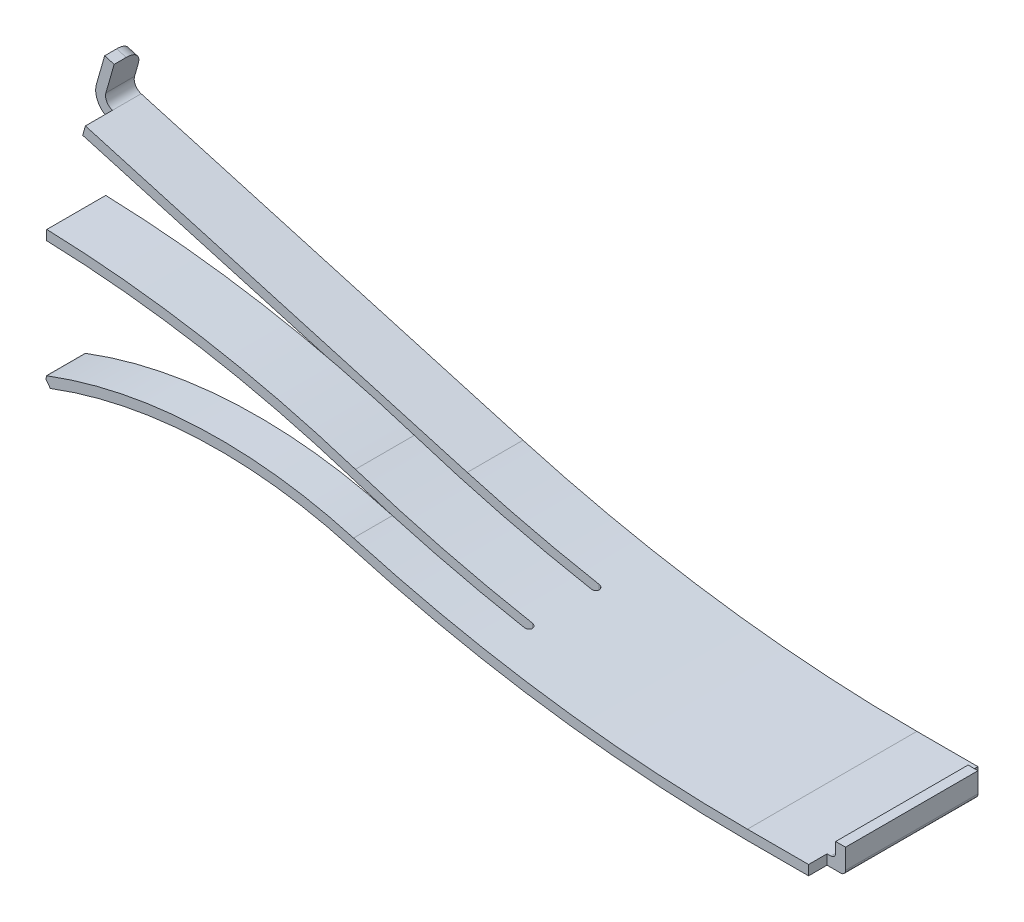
ISO-10303-21;
HEADER;
FILE_DESCRIPTION(('STEP AP214'),'2;1');
FILE_NAME('part.step','',(''),(''),'','','');
FILE_SCHEMA(('AUTOMOTIVE_DESIGN { 1 0 10303 214 1 1 1 1 }'));
ENDSEC;
DATA;
#1=APPLICATION_CONTEXT('core data for automotive mechanical design processes');
#2=APPLICATION_PROTOCOL_DEFINITION('international standard','automotive_design',2000,#1);
#3=PRODUCT_CONTEXT('',#1,'mechanical');
#4=PRODUCT('Part','Part','',(#3));
#5=PRODUCT_RELATED_PRODUCT_CATEGORY('part','',(#4));
#6=PRODUCT_DEFINITION_FORMATION('','',#4);
#7=PRODUCT_DEFINITION_CONTEXT('part definition',#1,'design');
#8=PRODUCT_DEFINITION('design','',#6,#7);
#9=PRODUCT_DEFINITION_SHAPE('','',#8);
#10=(LENGTH_UNIT() NAMED_UNIT(*) SI_UNIT(.MILLI.,.METRE.));
#11=(NAMED_UNIT(*) PLANE_ANGLE_UNIT() SI_UNIT($,.RADIAN.));
#12=(NAMED_UNIT(*) SI_UNIT($,.STERADIAN.) SOLID_ANGLE_UNIT());
#13=UNCERTAINTY_MEASURE_WITH_UNIT(LENGTH_MEASURE(1.E-05),#10,'distance_accuracy_value','');
#14=(GEOMETRIC_REPRESENTATION_CONTEXT(3) GLOBAL_UNCERTAINTY_ASSIGNED_CONTEXT((#13)) GLOBAL_UNIT_ASSIGNED_CONTEXT((#10,
#11,#12)) REPRESENTATION_CONTEXT('',''));
#15=CARTESIAN_POINT('',(0.,0.,0.));
#16=DIRECTION('',(0.,0.,1.));
#17=DIRECTION('',(1.,0.,0.));
#18=AXIS2_PLACEMENT_3D('',#15,#16,#17);
#19=CARTESIAN_POINT('',(-20.8915000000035,1.1246720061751,-8.7503));
#20=DIRECTION('',(0.,-1.,0.));
#21=DIRECTION('',(0.,0.,-1.));
#22=AXIS2_PLACEMENT_3D('',#19,#20,#21);
#23=CYLINDRICAL_SURFACE('',#22,0.317500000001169);
#24=DIRECTION('',(0.,-1.,0.));
#25=VECTOR('',#24,1.);
#26=CARTESIAN_POINT('',(-20.8915000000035,5.70770604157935,-9.0678));
#27=LINE('',#26,#25);
#28=CARTESIAN_POINT('',(-20.8915000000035,1.1246720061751,-9.0678));
#29=VERTEX_POINT('',#28);
#30=CARTESIAN_POINT('',(-20.8915000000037,1.92546895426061,-9.0678));
#31=VERTEX_POINT('',#30);
#32=EDGE_CURVE('E582',#29,#31,#27,.F.);
#33=ORIENTED_EDGE('',*,*,#32,.F.);
#34=CARTESIAN_POINT('',(-20.8915000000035,1.1246720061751,-8.4328));
#35=CARTESIAN_POINT('',(-20.8734229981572,1.1213349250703,-8.43278584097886));
#36=CARTESIAN_POINT('',(-20.8553477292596,1.11800298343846,-8.43434305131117));
#37=CARTESIAN_POINT('',(-20.8197076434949,1.11144169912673,-8.44049904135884));
#38=CARTESIAN_POINT('',(-20.8021427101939,1.10821233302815,-8.44509712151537));
#39=CARTESIAN_POINT('',(-20.768010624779,1.10194490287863,-8.45723763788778));
#40=CARTESIAN_POINT('',(-20.7514441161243,1.0989069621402,-8.46478194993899));
#41=CARTESIAN_POINT('',(-20.7198092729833,1.09311239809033,-8.48261008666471));
#42=CARTESIAN_POINT('',(-20.7047404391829,1.09035568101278,-8.49289299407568));
#43=CARTESIAN_POINT('',(-20.6766589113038,1.08522350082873,-8.51583106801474));
#44=CARTESIAN_POINT('',(-20.663630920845,1.08284519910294,-8.52846686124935));
#45=CARTESIAN_POINT('',(-20.6398848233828,1.07851379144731,-8.55581613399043));
#46=CARTESIAN_POINT('',(-20.6291669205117,1.07656072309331,-8.57052979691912));
#47=CARTESIAN_POINT('',(-20.6105295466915,1.07316661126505,-8.6013661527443));
#48=CARTESIAN_POINT('',(-20.6025684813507,1.07171795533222,-8.61746286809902));
#49=CARTESIAN_POINT('',(-20.5894628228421,1.06933408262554,-8.65079901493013));
#50=CARTESIAN_POINT('',(-20.5843177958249,1.06839878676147,-8.66803826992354));
#51=CARTESIAN_POINT('',(-20.577059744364,1.06707959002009,-8.70290610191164));
#52=CARTESIAN_POINT('',(-20.574904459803,1.06668800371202,-8.72052560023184));
#53=CARTESIAN_POINT('',(-20.5735565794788,1.06644309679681,-8.75588127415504));
#54=CARTESIAN_POINT('',(-20.5743638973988,1.06658976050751,-8.77361744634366));
#55=CARTESIAN_POINT('',(-20.5789002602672,1.06741410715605,-8.80857778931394));
#56=CARTESIAN_POINT('',(-20.5826097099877,1.06808822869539,-8.8258045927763));
#57=CARTESIAN_POINT('',(-20.5928114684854,1.06994311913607,-8.85938407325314));
#58=CARTESIAN_POINT('',(-20.5993037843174,1.0711238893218,-8.87573674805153));
#59=CARTESIAN_POINT('',(-20.6149023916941,1.07396279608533,-8.90717263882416));
#60=CARTESIAN_POINT('',(-20.6240181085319,1.07562265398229,-8.92225101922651));
#61=CARTESIAN_POINT('',(-20.6445811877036,1.07937018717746,-8.95066190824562));
#62=CARTESIAN_POINT('',(-20.6560285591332,1.0814578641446,-8.96399441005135));
#63=CARTESIAN_POINT('',(-20.6810747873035,1.08603024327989,-8.98871312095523));
#64=CARTESIAN_POINT('',(-20.6946981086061,1.08851946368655,-9.00007369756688));
#65=CARTESIAN_POINT('',(-20.7236063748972,1.0938076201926,-9.02035529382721));
#66=CARTESIAN_POINT('',(-20.7388919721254,1.09660667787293,-9.02927535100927));
#67=CARTESIAN_POINT('',(-20.7709551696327,1.10248531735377,-9.04457207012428));
#68=CARTESIAN_POINT('',(-20.7877532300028,1.10556876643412,-9.0509043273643));
#69=CARTESIAN_POINT('',(-20.8221270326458,1.11188681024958,-9.06064129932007));
#70=CARTESIAN_POINT('',(-20.8397016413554,1.11512118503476,-9.0640501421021));
#71=CARTESIAN_POINT('',(-20.8687440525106,1.1204731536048,-9.0671898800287));
#72=CARTESIAN_POINT('',(-20.8801251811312,1.12257223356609,-9.06780443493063));
#73=CARTESIAN_POINT('',(-20.8915000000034,1.12467200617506,-9.06780000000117));
#74=B_SPLINE_CURVE_WITH_KNOTS('',3,(#34,#35,#36,#37,#38,#39,#40,#41,#42,#43,#44,#45,#46,#47,#48,
#49,#50,#51,#52,#53,#54,#55,#56,#57,#58,#59,#60,#61,#62,#63,#64,#65,#66,#67,#68,#69,#70,#71,#72,
#73),.UNSPECIFIED.,.F.,.F.,(4,2,2,2,2,2,2,2,2,2,2,2,2,2,2,2,2,2,2,4),(0.,0.0550780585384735,
0.110143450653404,0.165243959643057,0.220326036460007,0.274973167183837,0.329625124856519,
0.383412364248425,0.437191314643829,0.490202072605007,0.543211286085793,0.595865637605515,
0.64852012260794,0.701366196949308,0.754212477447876,0.807701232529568,0.861211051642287,
0.915603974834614,0.969919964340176,1.00462053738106),.UNSPECIFIED.);
#75=CARTESIAN_POINT('',(-20.8915000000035,1.1246720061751,-8.4328));
#76=VERTEX_POINT('',#75);
#77=EDGE_CURVE('E44',#29,#76,#74,.F.);
#78=ORIENTED_EDGE('',*,*,#77,.T.);
#79=DIRECTION('',(0.,1.,0.));
#80=VECTOR('',#79,1.);
#81=CARTESIAN_POINT('',(-20.8915000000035,1.1246720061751,-8.4328));
#82=LINE('',#81,#80);
#83=CARTESIAN_POINT('',(-20.8915000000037,1.92546895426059,-8.4328));
#84=VERTEX_POINT('',#83);
#85=EDGE_CURVE('E580',#84,#76,#82,.F.);
#86=ORIENTED_EDGE('',*,*,#85,.F.);
#87=CARTESIAN_POINT('',(-20.8915000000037,1.92546895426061,-9.0678));
#88=CARTESIAN_POINT('',(-20.8734199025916,1.92210751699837,-9.06781414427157));
#89=CARTESIAN_POINT('',(-20.8553414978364,1.91875125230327,-9.06625641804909));
#90=CARTESIAN_POINT('',(-20.8196950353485,1.91214204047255,-9.06009823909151));
#91=CARTESIAN_POINT('',(-20.8021268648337,1.90888907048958,-9.05549846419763));
#92=CARTESIAN_POINT('',(-20.7679884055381,1.90257582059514,-9.0433532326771));
#93=CARTESIAN_POINT('',(-20.7514187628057,1.89951566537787,-9.03580589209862));
#94=CARTESIAN_POINT('',(-20.7197781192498,1.89367876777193,-9.01797022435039));
#95=CARTESIAN_POINT('',(-20.7047066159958,1.89090193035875,-9.00768282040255));
#96=CARTESIAN_POINT('',(-20.6766222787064,1.88573269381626,-8.98473558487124));
#97=CARTESIAN_POINT('',(-20.6635939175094,1.88333739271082,-8.97209542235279));
#98=CARTESIAN_POINT('',(-20.6398479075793,1.87897516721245,-8.94473643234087));
#99=CARTESIAN_POINT('',(-20.6291304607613,1.87700828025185,-8.930017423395));
#100=CARTESIAN_POINT('',(-20.610497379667,1.87359079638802,-8.89917317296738));
#101=CARTESIAN_POINT('',(-20.6025395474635,1.87213242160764,-8.88307428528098));
#102=CARTESIAN_POINT('',(-20.5894406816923,1.86973282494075,-8.84973387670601));
#103=CARTESIAN_POINT('',(-20.5842992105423,1.86879152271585,-8.83249253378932));
#104=CARTESIAN_POINT('',(-20.5770494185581,1.86746444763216,-8.79762441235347));
#105=CARTESIAN_POINT('',(-20.5748982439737,1.86707082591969,-8.78000683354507));
#106=CARTESIAN_POINT('',(-20.5735578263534,1.86682554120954,-8.74465561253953));
#107=CARTESIAN_POINT('',(-20.574368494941,1.86697386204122,-8.72692197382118));
#108=CARTESIAN_POINT('',(-20.578910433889,1.8678050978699,-8.69196886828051));
#109=CARTESIAN_POINT('',(-20.582621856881,1.86848437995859,-8.67474672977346));
#110=CARTESIAN_POINT('',(-20.5928259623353,1.87035290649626,-8.64117693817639));
#111=CARTESIAN_POINT('',(-20.5993186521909,1.87154215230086,-8.62482928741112));
#112=CARTESIAN_POINT('',(-20.6149166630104,1.87440116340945,-8.59340262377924));
#113=CARTESIAN_POINT('',(-20.6240315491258,1.87607268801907,-8.57832852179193));
#114=CARTESIAN_POINT('',(-20.6445913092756,1.87984629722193,-8.54992599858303));
#115=CARTESIAN_POINT('',(-20.6560361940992,1.88194838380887,-8.53659758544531));
#116=CARTESIAN_POINT('',(-20.6810779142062,1.88655249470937,-8.51188426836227));
#117=CARTESIAN_POINT('',(-20.6946995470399,1.88905913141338,-8.50052535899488));
#118=CARTESIAN_POINT('',(-20.7236034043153,1.89438413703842,-8.48024672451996));
#119=CARTESIAN_POINT('',(-20.7388862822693,1.89720262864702,-8.47132796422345));
#120=CARTESIAN_POINT('',(-20.7709466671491,1.90312261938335,-8.456031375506));
#121=CARTESIAN_POINT('',(-20.7877448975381,1.90622806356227,-8.44969854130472));
#122=CARTESIAN_POINT('',(-20.8221187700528,1.91259112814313,-8.43996053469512));
#123=CARTESIAN_POINT('',(-20.8396932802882,1.91584852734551,-8.4365512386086));
#124=CARTESIAN_POINT('',(-20.8687383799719,1.9212391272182,-8.43341042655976));
#125=CARTESIAN_POINT('',(-20.8801223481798,1.9233536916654,-8.43279557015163));
#126=CARTESIAN_POINT('',(-20.8915000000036,1.9254689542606,-8.43279999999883));
#127=B_SPLINE_CURVE_WITH_KNOTS('',3,(#87,#88,#89,#90,#91,#92,#93,#94,#95,#96,#97,#98,#99,#100,
#101,#102,#103,#104,#105,#106,#107,#108,#109,#110,#111,#112,#113,#114,#115,#116,#117,#118,#119,
#120,#121,#122,#123,#124,#125,#126),.UNSPECIFIED.,.F.,.F.,(4,2,2,2,2,2,2,2,2,2,2,2,2,2,2,2,2,2,
2,4),(0.,0.0551005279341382,0.110188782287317,0.165312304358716,0.220417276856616,
0.275080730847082,0.329748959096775,0.383539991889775,0.43732266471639,0.490326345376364,
0.543328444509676,0.595971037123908,0.648613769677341,0.701451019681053,0.754288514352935,
0.807777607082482,0.8612878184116,0.915693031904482,0.970021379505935,1.004738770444),.UNSPECIFIED.);
#128=EDGE_CURVE('E11',#84,#31,#127,.F.);
#129=ORIENTED_EDGE('',*,*,#128,.T.);
#130=EDGE_LOOP('',(#33,#78,#86,#129));
#131=FACE_BOUND('',#130,.T.);
#132=ADVANCED_FACE('F32',(#131),#23,.F.);
#133=CARTESIAN_POINT('',(-61.6606180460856,13.8404712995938,-79.0605465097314));
#134=DIRECTION('',(0.,0.,1.));
#135=DIRECTION('',(1.,0.,0.));
#136=AXIS2_PLACEMENT_3D('',#133,#134,#135);
#137=CYLINDRICAL_SURFACE('',#136,0.762000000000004);
#138=CARTESIAN_POINT('',(-61.6606180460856,13.8404712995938,-11.2268));
#139=DIRECTION('',(0.,0.,-1.));
#140=DIRECTION('',(1.,0.,0.));
#141=AXIS2_PLACEMENT_3D('',#138,#139,#140);
#142=CIRCLE('',#141,0.762000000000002);
#143=CARTESIAN_POINT('',(-61.8700545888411,13.1078183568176,-11.2268));
#144=VERTEX_POINT('',#143);
#145=CARTESIAN_POINT('',(-62.3932709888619,14.0499078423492,-11.2268));
#146=VERTEX_POINT('',#145);
#147=EDGE_CURVE('E281',#144,#146,#142,.T.);
#148=ORIENTED_EDGE('',*,*,#147,.F.);
#149=DIRECTION('',(0.,0.,1.));
#150=VECTOR('',#149,1.);
#151=CARTESIAN_POINT('',(-61.8700545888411,13.1078183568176,-79.0605465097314));
#152=LINE('',#151,#150);
#153=CARTESIAN_POINT('',(-61.8700545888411,13.1078183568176,-13.5128));
#154=VERTEX_POINT('',#153);
#155=EDGE_CURVE('E319',#154,#144,#152,.T.);
#156=ORIENTED_EDGE('',*,*,#155,.F.);
#157=CARTESIAN_POINT('',(-61.6606180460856,13.8404712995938,-13.5128));
#158=DIRECTION('',(0.,0.,1.));
#159=DIRECTION('',(1.,0.,0.));
#160=AXIS2_PLACEMENT_3D('',#157,#158,#159);
#161=CIRCLE('',#160,0.762000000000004);
#162=CARTESIAN_POINT('',(-62.3932709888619,14.0499078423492,-13.5128));
#163=VERTEX_POINT('',#162);
#164=EDGE_CURVE('E662',#154,#163,#161,.F.);
#165=ORIENTED_EDGE('',*,*,#164,.T.);
#166=DIRECTION('',(0.,0.,1.));
#167=VECTOR('',#166,1.);
#168=CARTESIAN_POINT('',(-62.3932709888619,14.0499078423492,-79.0605465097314));
#169=LINE('',#168,#167);
#170=EDGE_CURVE('E322',#163,#146,#169,.T.);
#171=ORIENTED_EDGE('',*,*,#170,.T.);
#172=EDGE_LOOP('',(#148,#156,#165,#171));
#173=FACE_BOUND('',#172,.T.);
#174=ADVANCED_FACE('F683',(#173),#137,.F.);
#175=CARTESIAN_POINT('',(-66.3458710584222,0.222883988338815,-79.0605465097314));
#176=DIRECTION('',(0.961486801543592,-0.274851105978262,0.));
#177=DIRECTION('',(0.274851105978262,0.961486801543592,0.));
#178=AXIS2_PLACEMENT_3D('',#175,#176,#177);
#179=PLANE('',#178);
#180=DIRECTION('',(-0.274851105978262,-0.961486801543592,0.));
#181=VECTOR('',#180,1.);
#182=CARTESIAN_POINT('',(-66.3458710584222,0.222883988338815,-13.5128));
#183=LINE('',#182,#181);
#184=CARTESIAN_POINT('',(-62.1000598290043,15.075621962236,-13.5128));
#185=VERTEX_POINT('',#184);
#186=EDGE_CURVE('E660',#185,#163,#183,.T.);
#187=ORIENTED_EDGE('',*,*,#186,.F.);
#188=CARTESIAN_POINT('',(-62.1000598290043,15.075621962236,-12.192));
#189=DIRECTION('',(0.961486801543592,-0.274851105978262,0.));
#190=DIRECTION('',(0.274851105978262,0.961486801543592,0.));
#191=AXIS2_PLACEMENT_3D('',#188,#189,#190);
#192=CIRCLE('',#191,1.3208);
#193=CARTESIAN_POINT('',(-61.7370364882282,16.3455537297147,-12.192));
#194=VERTEX_POINT('',#193);
#195=EDGE_CURVE('E585',#185,#194,#192,.T.);
#196=ORIENTED_EDGE('',*,*,#195,.T.);
#197=DIRECTION('',(0.,0.,1.));
#198=VECTOR('',#197,1.);
#199=CARTESIAN_POINT('',(-61.7370364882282,16.3455537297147,-79.0605465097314));
#200=LINE('',#199,#198);
#201=CARTESIAN_POINT('',(-61.7370364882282,16.3455537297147,-11.2268));
#202=VERTEX_POINT('',#201);
#203=EDGE_CURVE('E325',#194,#202,#200,.T.);
#204=ORIENTED_EDGE('',*,*,#203,.T.);
#205=DIRECTION('',(0.274851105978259,0.961486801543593,0.));
#206=VECTOR('',#205,1.);
#207=CARTESIAN_POINT('',(-62.3932709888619,14.0499078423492,-11.2268));
#208=LINE('',#207,#206);
#209=EDGE_CURVE('E672',#146,#202,#208,.T.);
#210=ORIENTED_EDGE('',*,*,#209,.F.);
#211=ORIENTED_EDGE('',*,*,#170,.F.);
#212=EDGE_LOOP('',(#187,#196,#204,#210,#211));
#213=FACE_BOUND('',#212,.T.);
#214=ADVANCED_FACE('F682',(#213),#179,.T.);
#215=CARTESIAN_POINT('',(-80.9240941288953,21.8303757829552,-79.0605465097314));
#216=DIRECTION('',(-0.274851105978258,-0.961486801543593,0.));
#217=DIRECTION('',(0.961486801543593,-0.274851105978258,0.));
#218=AXIS2_PLACEMENT_3D('',#215,#216,#217);
#219=PLANE('',#218);
#220=ORIENTED_EDGE('',*,*,#203,.F.);
#221=DIRECTION('',(-0.961486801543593,0.274851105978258,0.));
#222=VECTOR('',#221,1.);
#223=CARTESIAN_POINT('',(-80.9240941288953,21.8303757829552,-12.192));
#224=LINE('',#223,#222);
#225=CARTESIAN_POINT('',(-62.4941111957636,16.561971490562,-12.192));
#226=VERTEX_POINT('',#225);
#227=EDGE_CURVE('E590',#194,#226,#224,.T.);
#228=ORIENTED_EDGE('',*,*,#227,.T.);
#229=DIRECTION('',(0.,0.,1.));
#230=VECTOR('',#229,1.);
#231=CARTESIAN_POINT('',(-62.4941111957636,16.561971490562,-79.0605465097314));
#232=LINE('',#231,#230);
#233=CARTESIAN_POINT('',(-62.4941111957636,16.561971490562,-11.2268));
#234=VERTEX_POINT('',#233);
#235=EDGE_CURVE('E327',#226,#234,#232,.T.);
#236=ORIENTED_EDGE('',*,*,#235,.T.);
#237=DIRECTION('',(-0.961486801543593,0.274851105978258,0.));
#238=VECTOR('',#237,1.);
#239=CARTESIAN_POINT('',(-62.4941111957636,16.561971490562,-11.2268));
#240=LINE('',#239,#238);
#241=EDGE_CURVE('E670',#202,#234,#240,.T.);
#242=ORIENTED_EDGE('',*,*,#241,.F.);
#243=EDGE_LOOP('',(#220,#228,#236,#242));
#244=FACE_BOUND('',#243,.T.);
#245=ADVANCED_FACE('F753',(#244),#219,.F.);
#246=CARTESIAN_POINT('',(-67.1029457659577,0.439301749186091,-79.0605465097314));
#247=DIRECTION('',(0.961486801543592,-0.274851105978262,0.));
#248=DIRECTION('',(0.274851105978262,0.961486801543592,0.));
#249=AXIS2_PLACEMENT_3D('',#246,#247,#248);
#250=PLANE('',#249);
#251=ORIENTED_EDGE('',*,*,#235,.F.);
#252=CARTESIAN_POINT('',(-62.8571345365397,15.2920397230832,-12.192));
#253=DIRECTION('',(0.961486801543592,-0.274851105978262,0.));
#254=DIRECTION('',(0.274851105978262,0.961486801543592,0.));
#255=AXIS2_PLACEMENT_3D('',#252,#253,#254);
#256=CIRCLE('',#255,1.3208);
#257=CARTESIAN_POINT('',(-62.8571345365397,15.2920397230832,-13.5128));
#258=VERTEX_POINT('',#257);
#259=EDGE_CURVE('E589',#226,#258,#256,.F.);
#260=ORIENTED_EDGE('',*,*,#259,.T.);
#261=DIRECTION('',(-0.274851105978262,-0.961486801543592,0.));
#262=VECTOR('',#261,1.);
#263=CARTESIAN_POINT('',(-67.1029457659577,0.439301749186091,-13.5128));
#264=LINE('',#263,#262);
#265=CARTESIAN_POINT('',(-63.1503456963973,14.2663256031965,-13.5128));
#266=VERTEX_POINT('',#265);
#267=EDGE_CURVE('E658',#258,#266,#264,.T.);
#268=ORIENTED_EDGE('',*,*,#267,.T.);
#269=DIRECTION('',(0.,0.,1.));
#270=VECTOR('',#269,1.);
#271=CARTESIAN_POINT('',(-63.1503456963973,14.2663256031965,-79.0605465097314));
#272=LINE('',#271,#270);
#273=CARTESIAN_POINT('',(-63.1503456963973,14.2663256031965,-11.2268));
#274=VERTEX_POINT('',#273);
#275=EDGE_CURVE('E329',#266,#274,#272,.T.);
#276=ORIENTED_EDGE('',*,*,#275,.T.);
#277=DIRECTION('',(-0.274851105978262,-0.961486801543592,0.));
#278=VECTOR('',#277,1.);
#279=CARTESIAN_POINT('',(-63.1503456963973,14.2663256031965,-11.2268));
#280=LINE('',#279,#278);
#281=EDGE_CURVE('E288',#234,#274,#280,.T.);
#282=ORIENTED_EDGE('',*,*,#281,.F.);
#283=EDGE_LOOP('',(#251,#260,#268,#276,#282));
#284=FACE_BOUND('',#283,.T.);
#285=ADVANCED_FACE('F694',(#284),#250,.F.);
#286=CARTESIAN_POINT('',(-61.6606180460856,13.8404712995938,-79.0605465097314));
#287=DIRECTION('',(0.,0.,1.));
#288=DIRECTION('',(1.,0.,0.));
#289=AXIS2_PLACEMENT_3D('',#286,#287,#288);
#290=CYLINDRICAL_SURFACE('',#289,1.5494);
#291=DIRECTION('',(0.,0.,1.));
#292=VECTOR('',#291,1.);
#293=CARTESIAN_POINT('',(-62.0864723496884,12.3507436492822,-79.0605465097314));
#294=LINE('',#293,#292);
#295=CARTESIAN_POINT('',(-62.0864723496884,12.3507436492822,-13.5128));
#296=VERTEX_POINT('',#295);
#297=CARTESIAN_POINT('',(-62.0864723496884,12.3507436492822,-11.2268));
#298=VERTEX_POINT('',#297);
#299=EDGE_CURVE('E300',#296,#298,#294,.T.);
#300=ORIENTED_EDGE('',*,*,#299,.T.);
#301=CARTESIAN_POINT('',(-61.6606180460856,13.8404712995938,-11.2268));
#302=DIRECTION('',(0.,0.,1.));
#303=DIRECTION('',(1.,0.,0.));
#304=AXIS2_PLACEMENT_3D('',#301,#302,#303);
#305=CIRCLE('',#304,1.5494);
#306=EDGE_CURVE('E282',#274,#298,#305,.T.);
#307=ORIENTED_EDGE('',*,*,#306,.F.);
#308=ORIENTED_EDGE('',*,*,#275,.F.);
#309=CARTESIAN_POINT('',(-61.6606180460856,13.8404712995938,-13.5128));
#310=DIRECTION('',(0.,0.,1.));
#311=DIRECTION('',(1.,0.,0.));
#312=AXIS2_PLACEMENT_3D('',#309,#310,#311);
#313=CIRCLE('',#312,1.5494);
#314=EDGE_CURVE('E308',#296,#266,#313,.F.);
#315=ORIENTED_EDGE('',*,*,#314,.F.);
#316=EDGE_LOOP('',(#300,#307,#308,#315));
#317=FACE_BOUND('',#316,.T.);
#318=ADVANCED_FACE('F306',(#317),#290,.T.);
#319=CARTESIAN_POINT('',(-20.8915,1.92546895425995,-3.4163));
#320=DIRECTION('',(0.,-1.,0.));
#321=DIRECTION('',(0.,0.,-1.));
#322=AXIS2_PLACEMENT_3D('',#319,#320,#321);
#323=CYLINDRICAL_SURFACE('',#322,0.31750000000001);
#324=DIRECTION('',(0.,-1.,0.));
#325=VECTOR('',#324,1.);
#326=CARTESIAN_POINT('',(-20.8915,-47.7768240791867,-3.0988));
#327=LINE('',#326,#325);
#328=CARTESIAN_POINT('',(-20.8915,1.92546895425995,-3.0988));
#329=VERTEX_POINT('',#328);
#330=CARTESIAN_POINT('',(-20.8915,1.12467200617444,-3.0988));
#331=VERTEX_POINT('',#330);
#332=EDGE_CURVE('E514',#329,#331,#327,.T.);
#333=ORIENTED_EDGE('',*,*,#332,.F.);
#334=CARTESIAN_POINT('',(-20.8915000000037,1.92546895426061,-3.7338));
#335=CARTESIAN_POINT('',(-20.8734199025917,1.9221075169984,-3.73381414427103));
#336=CARTESIAN_POINT('',(-20.8553414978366,1.91875125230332,-3.73225641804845));
#337=CARTESIAN_POINT('',(-20.8196950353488,1.9121420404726,-3.72609823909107));
#338=CARTESIAN_POINT('',(-20.8021268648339,1.90888907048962,-3.72149846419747));
#339=CARTESIAN_POINT('',(-20.7679884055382,1.90257582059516,-3.7093532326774));
#340=CARTESIAN_POINT('',(-20.7514187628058,1.8995156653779,-3.7018058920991));
#341=CARTESIAN_POINT('',(-20.7197781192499,1.89367876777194,-3.68397022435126));
#342=CARTESIAN_POINT('',(-20.7047066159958,1.89090193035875,-3.67368282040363));
#343=CARTESIAN_POINT('',(-20.6766222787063,1.88573269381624,-3.65073558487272));
#344=CARTESIAN_POINT('',(-20.6635939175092,1.88333739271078,-3.63809542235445));
#345=CARTESIAN_POINT('',(-20.6398479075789,1.87897516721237,-3.61073643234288));
#346=CARTESIAN_POINT('',(-20.6291304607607,1.87700828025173,-3.59601742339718));
#347=CARTESIAN_POINT('',(-20.6104973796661,1.87359079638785,-3.56517317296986));
#348=CARTESIAN_POINT('',(-20.6025395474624,1.87213242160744,-3.54907428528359));
#349=CARTESIAN_POINT('',(-20.5894406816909,1.86973282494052,-3.51573387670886));
#350=CARTESIAN_POINT('',(-20.5842992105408,1.86879152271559,-3.49849253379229));
#351=CARTESIAN_POINT('',(-20.5770494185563,1.86746444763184,-3.46362441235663));
#352=CARTESIAN_POINT('',(-20.5748982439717,1.86707082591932,-3.44600683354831));
#353=CARTESIAN_POINT('',(-20.573557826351,1.8668255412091,-3.4106556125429));
#354=CARTESIAN_POINT('',(-20.5743684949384,1.86697386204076,-3.3929219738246));
#355=CARTESIAN_POINT('',(-20.578910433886,1.86780509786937,-3.35796886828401));
#356=CARTESIAN_POINT('',(-20.5826218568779,1.86848437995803,-3.34074672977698));
#357=CARTESIAN_POINT('',(-20.5928259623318,1.87035290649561,-3.30717693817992));
#358=CARTESIAN_POINT('',(-20.5993186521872,1.87154215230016,-3.29082928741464));
#359=CARTESIAN_POINT('',(-20.6149166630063,1.8744011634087,-3.2594026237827));
#360=CARTESIAN_POINT('',(-20.6240315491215,1.87607268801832,-3.24432852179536));
#361=CARTESIAN_POINT('',(-20.644591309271,1.8798462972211,-3.21592599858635));
#362=CARTESIAN_POINT('',(-20.6560361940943,1.88194838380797,-3.20259758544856));
#363=CARTESIAN_POINT('',(-20.681077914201,1.88655249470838,-3.17788426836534));
#364=CARTESIAN_POINT('',(-20.6946995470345,1.88905913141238,-3.16652535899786));
#365=CARTESIAN_POINT('',(-20.7236034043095,1.89438413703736,-3.14624672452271));
#366=CARTESIAN_POINT('',(-20.7388862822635,1.89720262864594,-3.13732796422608));
#367=CARTESIAN_POINT('',(-20.7709466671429,1.90312261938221,-3.12203137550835));
#368=CARTESIAN_POINT('',(-20.7877448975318,1.9062280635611,-3.11569854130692));
#369=CARTESIAN_POINT('',(-20.8221187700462,1.91259112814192,-3.10596053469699));
#370=CARTESIAN_POINT('',(-20.8396932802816,1.91584852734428,-3.1025512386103));
#371=CARTESIAN_POINT('',(-20.8687383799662,1.92123912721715,-3.09941042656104));
#372=CARTESIAN_POINT('',(-20.8801223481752,1.92335369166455,-3.09879557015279));
#373=CARTESIAN_POINT('',(-20.8915,1.92546895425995,-3.09879999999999));
#374=B_SPLINE_CURVE_WITH_KNOTS('',3,(#334,#335,#336,#337,#338,#339,#340,#341,#342,#343,#344,
#345,#346,#347,#348,#349,#350,#351,#352,#353,#354,#355,#356,#357,#358,#359,#360,#361,#362,#363,
#364,#365,#366,#367,#368,#369,#370,#371,#372,#373),.UNSPECIFIED.,.F.,.F.,(4,2,2,2,2,2,2,2,2,2,2,
2,2,2,2,2,2,2,2,4),(0.,0.0551005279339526,0.110188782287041,0.165312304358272,0.220417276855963,
0.275080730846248,0.329748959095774,0.383539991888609,0.437322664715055,0.490326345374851,
0.543328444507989,0.595971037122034,0.648613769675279,0.701451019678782,0.754288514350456,
0.80777760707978,0.861287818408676,0.915693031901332,0.97002137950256,1.00473877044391),.UNSPECIFIED.);
#375=CARTESIAN_POINT('',(-20.8915000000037,1.92546895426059,-3.7338));
#376=VERTEX_POINT('',#375);
#377=EDGE_CURVE('E521',#329,#376,#374,.F.);
#378=ORIENTED_EDGE('',*,*,#377,.T.);
#379=DIRECTION('',(0.,-1.,0.));
#380=VECTOR('',#379,1.);
#381=CARTESIAN_POINT('',(-20.8915,114.3,-3.7338));
#382=LINE('',#381,#380);
#383=CARTESIAN_POINT('',(-20.8915000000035,1.1246720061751,-3.7338));
#384=VERTEX_POINT('',#383);
#385=EDGE_CURVE('E517',#384,#376,#382,.F.);
#386=ORIENTED_EDGE('',*,*,#385,.F.);
#387=CARTESIAN_POINT('',(-20.8915,1.12467200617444,-3.0988));
#388=CARTESIAN_POINT('',(-20.8734229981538,1.12133492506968,-3.0987858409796));
#389=CARTESIAN_POINT('',(-20.8553477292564,1.11800298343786,-3.1003430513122));
#390=CARTESIAN_POINT('',(-20.8197076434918,1.11144169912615,-3.10649904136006));
#391=CARTESIAN_POINT('',(-20.8021427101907,1.10821233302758,-3.1110971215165));
#392=CARTESIAN_POINT('',(-20.768010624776,1.10194490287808,-3.12323763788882));
#393=CARTESIAN_POINT('',(-20.7514441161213,1.09890696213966,-3.13078194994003));
#394=CARTESIAN_POINT('',(-20.7198092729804,1.09311239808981,-3.1486100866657));
#395=CARTESIAN_POINT('',(-20.7047404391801,1.09035568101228,-3.15889299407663));
#396=CARTESIAN_POINT('',(-20.6766589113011,1.08522350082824,-3.1818310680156));
#397=CARTESIAN_POINT('',(-20.6636309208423,1.08284519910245,-3.19446686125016));
#398=CARTESIAN_POINT('',(-20.6398848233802,1.07851379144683,-3.22181613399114));
#399=CARTESIAN_POINT('',(-20.6291669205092,1.07656072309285,-3.23652979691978));
#400=CARTESIAN_POINT('',(-20.610529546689,1.07316661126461,-3.26736615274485));
#401=CARTESIAN_POINT('',(-20.6025684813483,1.07171795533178,-3.28346286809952));
#402=CARTESIAN_POINT('',(-20.5894628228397,1.0693340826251,-3.3167990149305));
#403=CARTESIAN_POINT('',(-20.5843177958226,1.06839878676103,-3.33403826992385));
#404=CARTESIAN_POINT('',(-20.5770597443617,1.06707959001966,-3.36890610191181));
#405=CARTESIAN_POINT('',(-20.5749044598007,1.06668800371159,-3.38652560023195));
#406=CARTESIAN_POINT('',(-20.5735565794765,1.06644309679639,-3.42188127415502));
#407=CARTESIAN_POINT('',(-20.5743638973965,1.06658976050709,-3.43961744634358));
#408=CARTESIAN_POINT('',(-20.5789002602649,1.06741410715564,-3.47457778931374));
#409=CARTESIAN_POINT('',(-20.5826097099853,1.06808822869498,-3.49180459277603));
#410=CARTESIAN_POINT('',(-20.592811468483,1.06994311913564,-3.52538407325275));
#411=CARTESIAN_POINT('',(-20.599303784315,1.07112388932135,-3.54173674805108));
#412=CARTESIAN_POINT('',(-20.6149023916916,1.07396279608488,-3.57317263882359));
#413=CARTESIAN_POINT('',(-20.6240181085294,1.07562265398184,-3.58825101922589));
#414=CARTESIAN_POINT('',(-20.644581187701,1.079370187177,-3.61666190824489));
#415=CARTESIAN_POINT('',(-20.6560285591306,1.08145786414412,-3.62999441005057));
#416=CARTESIAN_POINT('',(-20.6810747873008,1.08603024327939,-3.65471312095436));
#417=CARTESIAN_POINT('',(-20.6946981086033,1.08851946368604,-3.66607369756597));
#418=CARTESIAN_POINT('',(-20.7236063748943,1.09380762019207,-3.68635529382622));
#419=CARTESIAN_POINT('',(-20.7388919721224,1.09660667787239,-3.69527535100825));
#420=CARTESIAN_POINT('',(-20.7709551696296,1.10248531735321,-3.71057207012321));
#421=CARTESIAN_POINT('',(-20.7877532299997,1.10556876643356,-3.7169043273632));
#422=CARTESIAN_POINT('',(-20.8221270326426,1.111886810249,-3.72664129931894));
#423=CARTESIAN_POINT('',(-20.8397016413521,1.11512118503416,-3.73005014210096));
#424=CARTESIAN_POINT('',(-20.8687440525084,1.12047315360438,-3.73318988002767));
#425=CARTESIAN_POINT('',(-20.8801251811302,1.12257223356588,-3.7338044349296));
#426=CARTESIAN_POINT('',(-20.8915000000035,1.12467200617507,-3.73380000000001));
#427=B_SPLINE_CURVE_WITH_KNOTS('',3,(#387,#388,#389,#390,#391,#392,#393,#394,#395,#396,#397,
#398,#399,#400,#401,#402,#403,#404,#405,#406,#407,#408,#409,#410,#411,#412,#413,#414,#415,#416,
#417,#418,#419,#420,#421,#422,#423,#424,#425,#426),.UNSPECIFIED.,.F.,.F.,(4,2,2,2,2,2,2,2,2,2,2,
2,2,2,2,2,2,2,2,4),(0.,0.0550780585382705,0.110143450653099,0.165243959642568,0.220326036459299,
0.27497316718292,0.329625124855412,0.383412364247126,0.437191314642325,0.490202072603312,
0.543211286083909,0.595865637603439,0.648520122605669,0.701366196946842,0.754212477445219,
0.807701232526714,0.861211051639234,0.91560397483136,0.969919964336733,1.00462053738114),.UNSPECIFIED.);
#428=EDGE_CURVE('E527',#384,#331,#427,.F.);
#429=ORIENTED_EDGE('',*,*,#428,.T.);
#430=EDGE_LOOP('',(#333,#378,#386,#429));
#431=FACE_BOUND('',#430,.T.);
#432=ADVANCED_FACE('F533',(#431),#323,.F.);
#433=CARTESIAN_POINT('',(5.18160000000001,0.381,-13.5128));
#434=DIRECTION('',(0.,0.,1.));
#435=DIRECTION('',(1.,0.,0.));
#436=AXIS2_PLACEMENT_3D('',#433,#434,#435);
#437=CYLINDRICAL_SURFACE('',#436,0.381000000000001);
#438=CARTESIAN_POINT('',(5.18160000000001,0.381,-12.0396));
#439=DIRECTION('',(0.,0.,1.));
#440=DIRECTION('',(1.,0.,0.));
#441=AXIS2_PLACEMENT_3D('',#438,#439,#440);
#442=CIRCLE('',#441,0.381000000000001);
#443=CARTESIAN_POINT('',(5.18160000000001,0.,-12.0396));
#444=VERTEX_POINT('',#443);
#445=CARTESIAN_POINT('',(5.56260000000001,0.381,-12.0396));
#446=VERTEX_POINT('',#445);
#447=EDGE_CURVE('E394',#444,#446,#442,.T.);
#448=ORIENTED_EDGE('',*,*,#447,.F.);
#449=DIRECTION('',(0.,0.,1.));
#450=VECTOR('',#449,1.);
#451=CARTESIAN_POINT('',(5.18160000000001,0.,-13.5128));
#452=LINE('',#451,#450);
#453=CARTESIAN_POINT('',(5.18160000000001,0.,-1.4732));
#454=VERTEX_POINT('',#453);
#455=EDGE_CURVE('E493',#444,#454,#452,.T.);
#456=ORIENTED_EDGE('',*,*,#455,.T.);
#457=CARTESIAN_POINT('',(5.18160000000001,0.381,-1.4732));
#458=DIRECTION('',(0.,0.,1.));
#459=DIRECTION('',(1.,0.,0.));
#460=AXIS2_PLACEMENT_3D('',#457,#458,#459);
#461=CIRCLE('',#460,0.381000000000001);
#462=CARTESIAN_POINT('',(5.56260000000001,0.380999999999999,-1.4732));
#463=VERTEX_POINT('',#462);
#464=EDGE_CURVE('E423',#454,#463,#461,.T.);
#465=ORIENTED_EDGE('',*,*,#464,.T.);
#466=DIRECTION('',(0.,0.,1.));
#467=VECTOR('',#466,1.);
#468=CARTESIAN_POINT('',(5.56260000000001,0.380999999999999,-13.5128));
#469=LINE('',#468,#467);
#470=EDGE_CURVE('E495',#446,#463,#469,.T.);
#471=ORIENTED_EDGE('',*,*,#470,.F.);
#472=EDGE_LOOP('',(#448,#456,#465,#471));
#473=FACE_BOUND('',#472,.T.);
#474=ADVANCED_FACE('F549',(#473),#437,.F.);
#475=CARTESIAN_POINT('',(5.56259999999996,-47.7768240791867,-13.5128));
#476=DIRECTION('',(1.,0.,0.));
#477=DIRECTION('',(0.,1.,0.));
#478=AXIS2_PLACEMENT_3D('',#475,#476,#477);
#479=PLANE('',#478);
#480=DIRECTION('',(0.,0.,1.));
#481=VECTOR('',#480,1.);
#482=CARTESIAN_POINT('',(5.56260000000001,1.19379999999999,-13.5128));
#483=LINE('',#482,#481);
#484=CARTESIAN_POINT('',(5.56260000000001,1.19379999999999,-12.0396));
#485=VERTEX_POINT('',#484);
#486=CARTESIAN_POINT('',(5.56260000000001,1.1938,-1.4732));
#487=VERTEX_POINT('',#486);
#488=EDGE_CURVE('E497',#485,#487,#483,.T.);
#489=ORIENTED_EDGE('',*,*,#488,.F.);
#490=DIRECTION('',(0.,-1.,0.));
#491=VECTOR('',#490,1.);
#492=CARTESIAN_POINT('',(5.56259999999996,-47.7768240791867,-12.0396));
#493=LINE('',#492,#491);
#494=EDGE_CURVE('E396',#485,#446,#493,.T.);
#495=ORIENTED_EDGE('',*,*,#494,.T.);
#496=ORIENTED_EDGE('',*,*,#470,.T.);
#497=DIRECTION('',(0.,-1.,0.));
#498=VECTOR('',#497,1.);
#499=CARTESIAN_POINT('',(5.56259999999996,-47.7768240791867,-1.4732));
#500=LINE('',#499,#498);
#501=EDGE_CURVE('E420',#487,#463,#500,.T.);
#502=ORIENTED_EDGE('',*,*,#501,.F.);
#503=EDGE_LOOP('',(#489,#495,#496,#502));
#504=FACE_BOUND('',#503,.T.);
#505=ADVANCED_FACE('F552',(#504),#479,.F.);
#506=CARTESIAN_POINT('',(-24.8917708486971,1.19379999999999,-13.5128));
#507=DIRECTION('',(0.,-1.,0.));
#508=DIRECTION('',(1.,0.,0.));
#509=AXIS2_PLACEMENT_3D('',#506,#507,#508);
#510=PLANE('',#509);
#511=DIRECTION('',(0.,0.,1.));
#512=VECTOR('',#511,1.);
#513=CARTESIAN_POINT('',(6.35000000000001,1.1938,-13.5128));
#514=LINE('',#513,#512);
#515=CARTESIAN_POINT('',(6.35000000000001,1.1938,-12.0396));
#516=VERTEX_POINT('',#515);
#517=CARTESIAN_POINT('',(6.35000000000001,1.1938,-1.4732));
#518=VERTEX_POINT('',#517);
#519=EDGE_CURVE('E499',#516,#518,#514,.T.);
#520=ORIENTED_EDGE('',*,*,#519,.F.);
#521=DIRECTION('',(-1.,0.,0.));
#522=VECTOR('',#521,1.);
#523=CARTESIAN_POINT('',(-24.8917708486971,1.19379999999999,-12.0396));
#524=LINE('',#523,#522);
#525=EDGE_CURVE('E399',#516,#485,#524,.T.);
#526=ORIENTED_EDGE('',*,*,#525,.T.);
#527=ORIENTED_EDGE('',*,*,#488,.T.);
#528=DIRECTION('',(-1.,0.,0.));
#529=VECTOR('',#528,1.);
#530=CARTESIAN_POINT('',(-24.8917708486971,1.19379999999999,-1.4732));
#531=LINE('',#530,#529);
#532=EDGE_CURVE('E417',#518,#487,#531,.T.);
#533=ORIENTED_EDGE('',*,*,#532,.F.);
#534=EDGE_LOOP('',(#520,#526,#527,#533));
#535=FACE_BOUND('',#534,.T.);
#536=ADVANCED_FACE('F556',(#535),#510,.F.);
#537=CARTESIAN_POINT('',(6.35000000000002,-47.7768240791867,-13.5128));
#538=DIRECTION('',(-1.,0.,0.));
#539=DIRECTION('',(0.,0.,1.));
#540=AXIS2_PLACEMENT_3D('',#537,#538,#539);
#541=PLANE('',#540);
#542=DIRECTION('',(0.,0.,1.));
#543=VECTOR('',#542,1.);
#544=CARTESIAN_POINT('',(6.35000000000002,-0.406400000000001,-13.5128));
#545=LINE('',#544,#543);
#546=CARTESIAN_POINT('',(6.35000000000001,-0.4064,-12.0396));
#547=VERTEX_POINT('',#546);
#548=CARTESIAN_POINT('',(6.35000000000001,-0.4064,-1.4732));
#549=VERTEX_POINT('',#548);
#550=EDGE_CURVE('E501',#547,#549,#545,.T.);
#551=ORIENTED_EDGE('',*,*,#550,.F.);
#552=DIRECTION('',(0.,-1.,0.));
#553=VECTOR('',#552,1.);
#554=CARTESIAN_POINT('',(6.35000000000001,2.77802108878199,-12.0396));
#555=LINE('',#554,#553);
#556=EDGE_CURVE('E380',#516,#547,#555,.T.);
#557=ORIENTED_EDGE('',*,*,#556,.F.);
#558=ORIENTED_EDGE('',*,*,#519,.T.);
#559=DIRECTION('',(0.,1.,0.));
#560=VECTOR('',#559,1.);
#561=CARTESIAN_POINT('',(6.35000000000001,2.77802108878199,-1.4732));
#562=LINE('',#561,#560);
#563=EDGE_CURVE('E405',#549,#518,#562,.T.);
#564=ORIENTED_EDGE('',*,*,#563,.F.);
#565=EDGE_LOOP('',(#551,#557,#558,#564));
#566=FACE_BOUND('',#565,.T.);
#567=ADVANCED_FACE('F560',(#566),#541,.F.);
#568=CARTESIAN_POINT('',(5.96900000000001,-0.4064,-13.5128));
#569=DIRECTION('',(0.,0.,1.));
#570=DIRECTION('',(1.,0.,0.));
#571=AXIS2_PLACEMENT_3D('',#568,#569,#570);
#572=CYLINDRICAL_SURFACE('',#571,0.381000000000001);
#573=DIRECTION('',(0.,0.,1.));
#574=VECTOR('',#573,1.);
#575=CARTESIAN_POINT('',(5.96900000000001,-0.787399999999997,-13.5128));
#576=LINE('',#575,#574);
#577=CARTESIAN_POINT('',(5.96900000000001,-0.787399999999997,-12.0396));
#578=VERTEX_POINT('',#577);
#579=CARTESIAN_POINT('',(5.96900000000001,-0.787399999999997,-1.4732));
#580=VERTEX_POINT('',#579);
#581=EDGE_CURVE('E503',#578,#580,#576,.T.);
#582=ORIENTED_EDGE('',*,*,#581,.F.);
#583=CARTESIAN_POINT('',(5.96900000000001,-0.4064,-12.0396));
#584=DIRECTION('',(0.,0.,1.));
#585=DIRECTION('',(1.,0.,0.));
#586=AXIS2_PLACEMENT_3D('',#583,#584,#585);
#587=CIRCLE('',#586,0.381000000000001);
#588=EDGE_CURVE('E388',#578,#547,#587,.T.);
#589=ORIENTED_EDGE('',*,*,#588,.T.);
#590=ORIENTED_EDGE('',*,*,#550,.T.);
#591=CARTESIAN_POINT('',(5.96900000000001,-0.4064,-1.4732));
#592=DIRECTION('',(0.,0.,1.));
#593=DIRECTION('',(1.,0.,0.));
#594=AXIS2_PLACEMENT_3D('',#591,#592,#593);
#595=CIRCLE('',#594,0.381000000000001);
#596=EDGE_CURVE('E414',#580,#549,#595,.T.);
#597=ORIENTED_EDGE('',*,*,#596,.F.);
#598=EDGE_LOOP('',(#582,#589,#590,#597));
#599=FACE_BOUND('',#598,.T.);
#600=ADVANCED_FACE('F564',(#599),#572,.T.);
#601=CARTESIAN_POINT('',(0.,114.3,-13.5128));
#602=DIRECTION('',(0.,0.,1.));
#603=DIRECTION('',(1.,0.,0.));
#604=AXIS2_PLACEMENT_3D('',#601,#602,#603);
#605=CYLINDRICAL_SURFACE('',#604,115.0874);
#606=ORIENTED_EDGE('',*,*,#77,.F.);
#607=CARTESIAN_POINT('',(0.,114.3,-9.0678));
#608=DIRECTION('',(0.,0.,-1.));
#609=DIRECTION('',(-1.,0.,0.));
#610=AXIS2_PLACEMENT_3D('',#607,#608,#609);
#611=CIRCLE('',#610,115.0874);
#612=CARTESIAN_POINT('',(-31.6318991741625,3.64498387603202,-9.0678));
#613=VERTEX_POINT('',#612);
#614=EDGE_CURVE('E313',#29,#613,#611,.T.);
#615=ORIENTED_EDGE('',*,*,#614,.T.);
#616=DIRECTION('',(0.,0.,1.));
#617=VECTOR('',#616,1.);
#618=CARTESIAN_POINT('',(-31.6318991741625,3.64498387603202,-79.0605465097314));
#619=LINE('',#618,#617);
#620=CARTESIAN_POINT('',(-31.6318991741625,3.64498387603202,-13.5128));
#621=VERTEX_POINT('',#620);
#622=EDGE_CURVE('E309',#621,#613,#619,.T.);
#623=ORIENTED_EDGE('',*,*,#622,.F.);
#624=CARTESIAN_POINT('',(0.,114.3,-13.5128));
#625=DIRECTION('',(0.,0.,1.));
#626=DIRECTION('',(1.,0.,0.));
#627=AXIS2_PLACEMENT_3D('',#624,#625,#626);
#628=CIRCLE('',#627,115.0874);
#629=CARTESIAN_POINT('',(0.,-0.787399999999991,-13.5128));
#630=VERTEX_POINT('',#629);
#631=EDGE_CURVE('E471',#630,#621,#628,.F.);
#632=ORIENTED_EDGE('',*,*,#631,.F.);
#633=DIRECTION('',(0.,0.,1.));
#634=VECTOR('',#633,1.);
#635=CARTESIAN_POINT('',(0.,-0.787399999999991,-13.5128));
#636=LINE('',#635,#634);
#637=CARTESIAN_POINT('',(0.,-0.787399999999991,0.));
#638=VERTEX_POINT('',#637);
#639=EDGE_CURVE('E481',#630,#638,#636,.T.);
#640=ORIENTED_EDGE('',*,*,#639,.T.);
#641=CARTESIAN_POINT('',(0.,114.3,0.));
#642=DIRECTION('',(0.,0.,1.));
#643=DIRECTION('',(1.,0.,0.));
#644=AXIS2_PLACEMENT_3D('',#641,#642,#643);
#645=CIRCLE('',#644,115.0874);
#646=CARTESIAN_POINT('',(-31.6318991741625,3.64498387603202,0.));
#647=VERTEX_POINT('',#646);
#648=EDGE_CURVE('E454',#638,#647,#645,.F.);
#649=ORIENTED_EDGE('',*,*,#648,.T.);
#650=DIRECTION('',(0.,0.,1.));
#651=VECTOR('',#650,1.);
#652=CARTESIAN_POINT('',(-31.6318991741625,3.64498387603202,-3.0988));
#653=LINE('',#652,#651);
#654=CARTESIAN_POINT('',(-31.6318991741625,3.64498387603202,-3.0988));
#655=VERTEX_POINT('',#654);
#656=EDGE_CURVE('E455',#655,#647,#653,.T.);
#657=ORIENTED_EDGE('',*,*,#656,.F.);
#658=CARTESIAN_POINT('',(0.,114.3,-3.0988));
#659=DIRECTION('',(0.,0.,1.));
#660=DIRECTION('',(1.,0.,0.));
#661=AXIS2_PLACEMENT_3D('',#658,#659,#660);
#662=CIRCLE('',#661,115.0874);
#663=EDGE_CURVE('E441',#331,#655,#662,.F.);
#664=ORIENTED_EDGE('',*,*,#663,.F.);
#665=ORIENTED_EDGE('',*,*,#428,.F.);
#666=CARTESIAN_POINT('',(0.,114.3,-3.7338));
#667=DIRECTION('',(0.,0.,-1.));
#668=DIRECTION('',(-1.,0.,0.));
#669=AXIS2_PLACEMENT_3D('',#666,#667,#668);
#670=CIRCLE('',#669,115.0874);
#671=CARTESIAN_POINT('',(-35.2403619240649,4.74076246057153,-3.7338));
#672=VERTEX_POINT('',#671);
#673=EDGE_CURVE('E351',#384,#672,#670,.T.);
#674=ORIENTED_EDGE('',*,*,#673,.T.);
#675=DIRECTION('',(0.,0.,1.));
#676=VECTOR('',#675,1.);
#677=CARTESIAN_POINT('',(-35.2403619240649,4.74076246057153,-8.4328));
#678=LINE('',#677,#676);
#679=CARTESIAN_POINT('',(-35.2403619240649,4.74076246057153,-8.4328));
#680=VERTEX_POINT('',#679);
#681=EDGE_CURVE('E374',#680,#672,#678,.T.);
#682=ORIENTED_EDGE('',*,*,#681,.F.);
#683=CARTESIAN_POINT('',(0.,114.3,-8.4328));
#684=DIRECTION('',(0.,0.,-1.));
#685=DIRECTION('',(-1.,0.,0.));
#686=AXIS2_PLACEMENT_3D('',#683,#684,#685);
#687=CIRCLE('',#686,115.0874);
#688=EDGE_CURVE('E334',#76,#680,#687,.T.);
#689=ORIENTED_EDGE('',*,*,#688,.F.);
#690=EDGE_LOOP('',(#606,#615,#623,#632,#640,#649,#657,#664,#665,#674,#682,#689));
#691=FACE_BOUND('',#690,.T.);
#692=ADVANCED_FACE('F541',(#691),#605,.T.);
#693=CARTESIAN_POINT('',(0.,114.3,-13.5128));
#694=DIRECTION('',(0.,0.,1.));
#695=DIRECTION('',(1.,0.,0.));
#696=AXIS2_PLACEMENT_3D('',#693,#694,#695);
#697=CYLINDRICAL_SURFACE('',#696,114.3);
#698=ORIENTED_EDGE('',*,*,#128,.F.);
#699=CARTESIAN_POINT('',(0.,114.3,-8.4328));
#700=DIRECTION('',(0.,0.,-1.));
#701=DIRECTION('',(-1.,0.,0.));
#702=AXIS2_PLACEMENT_3D('',#699,#700,#701);
#703=CIRCLE('',#702,114.3);
#704=CARTESIAN_POINT('',(-34.9992559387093,5.49034011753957,-8.4328));
#705=VERTEX_POINT('',#704);
#706=EDGE_CURVE('E348',#84,#705,#703,.T.);
#707=ORIENTED_EDGE('',*,*,#706,.T.);
#708=DIRECTION('',(0.,0.,1.));
#709=VECTOR('',#708,1.);
#710=CARTESIAN_POINT('',(-34.9992559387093,5.49034011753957,-8.4328));
#711=LINE('',#710,#709);
#712=CARTESIAN_POINT('',(-34.9992559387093,5.49034011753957,-3.7338));
#713=VERTEX_POINT('',#712);
#714=EDGE_CURVE('E350',#705,#713,#711,.T.);
#715=ORIENTED_EDGE('',*,*,#714,.T.);
#716=CARTESIAN_POINT('',(0.,114.3,-3.7338));
#717=DIRECTION('',(0.,0.,-1.));
#718=DIRECTION('',(-1.,0.,0.));
#719=AXIS2_PLACEMENT_3D('',#716,#717,#718);
#720=CIRCLE('',#719,114.3);
#721=EDGE_CURVE('E337',#376,#713,#720,.T.);
#722=ORIENTED_EDGE('',*,*,#721,.F.);
#723=ORIENTED_EDGE('',*,*,#377,.F.);
#724=CARTESIAN_POINT('',(0.,114.3,-3.0988));
#725=DIRECTION('',(0.,0.,1.));
#726=DIRECTION('',(1.,0.,0.));
#727=AXIS2_PLACEMENT_3D('',#724,#725,#726);
#728=CIRCLE('',#727,114.3);
#729=CARTESIAN_POINT('',(-31.4154814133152,4.40205858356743,-3.0988));
#730=VERTEX_POINT('',#729);
#731=EDGE_CURVE('E470',#329,#730,#728,.F.);
#732=ORIENTED_EDGE('',*,*,#731,.T.);
#733=DIRECTION('',(0.,0.,1.));
#734=VECTOR('',#733,1.);
#735=CARTESIAN_POINT('',(-31.4154814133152,4.40205858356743,-3.0988));
#736=LINE('',#735,#734);
#737=CARTESIAN_POINT('',(-31.4154814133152,4.40205858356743,0.));
#738=VERTEX_POINT('',#737);
#739=EDGE_CURVE('E451',#730,#738,#736,.T.);
#740=ORIENTED_EDGE('',*,*,#739,.T.);
#741=CARTESIAN_POINT('',(0.,114.3,0.));
#742=DIRECTION('',(0.,0.,1.));
#743=DIRECTION('',(1.,0.,0.));
#744=AXIS2_PLACEMENT_3D('',#741,#742,#743);
#745=CIRCLE('',#744,114.3);
#746=CARTESIAN_POINT('',(0.,0.,0.));
#747=VERTEX_POINT('',#746);
#748=EDGE_CURVE('E474',#747,#738,#745,.F.);
#749=ORIENTED_EDGE('',*,*,#748,.F.);
#750=DIRECTION('',(0.,0.,1.));
#751=VECTOR('',#750,1.);
#752=CARTESIAN_POINT('',(0.,0.,-13.5128));
#753=LINE('',#752,#751);
#754=CARTESIAN_POINT('',(0.,0.,-13.5128));
#755=VERTEX_POINT('',#754);
#756=EDGE_CURVE('E490',#755,#747,#753,.T.);
#757=ORIENTED_EDGE('',*,*,#756,.F.);
#758=CARTESIAN_POINT('',(0.,114.3,-13.5128));
#759=DIRECTION('',(0.,0.,1.));
#760=DIRECTION('',(1.,0.,0.));
#761=AXIS2_PLACEMENT_3D('',#758,#759,#760);
#762=CIRCLE('',#761,114.3);
#763=CARTESIAN_POINT('',(-31.4154814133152,4.40205858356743,-13.5128));
#764=VERTEX_POINT('',#763);
#765=EDGE_CURVE('E479',#755,#764,#762,.F.);
#766=ORIENTED_EDGE('',*,*,#765,.T.);
#767=DIRECTION('',(0.,0.,1.));
#768=VECTOR('',#767,1.);
#769=CARTESIAN_POINT('',(-31.4154814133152,4.40205858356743,-79.0605465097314));
#770=LINE('',#769,#768);
#771=CARTESIAN_POINT('',(-31.4154814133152,4.40205858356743,-9.0678));
#772=VERTEX_POINT('',#771);
#773=EDGE_CURVE('E311',#764,#772,#770,.T.);
#774=ORIENTED_EDGE('',*,*,#773,.T.);
#775=CARTESIAN_POINT('',(0.,114.3,-9.0678));
#776=DIRECTION('',(0.,0.,-1.));
#777=DIRECTION('',(-1.,0.,0.));
#778=AXIS2_PLACEMENT_3D('',#775,#776,#777);
#779=CIRCLE('',#778,114.3);
#780=EDGE_CURVE('E651',#31,#772,#779,.T.);
#781=ORIENTED_EDGE('',*,*,#780,.F.);
#782=EDGE_LOOP('',(#698,#707,#715,#722,#723,#732,#740,#749,#757,#766,#774,#781));
#783=FACE_BOUND('',#782,.T.);
#784=ADVANCED_FACE('F535',(#783),#697,.F.);
#785=CARTESIAN_POINT('',(-24.891770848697,0.,-13.5128));
#786=DIRECTION('',(0.,-1.,0.));
#787=DIRECTION('',(0.,0.,-1.));
#788=AXIS2_PLACEMENT_3D('',#785,#786,#787);
#789=PLANE('',#788);
#790=DIRECTION('',(-1.,0.,0.));
#791=VECTOR('',#790,1.);
#792=CARTESIAN_POINT('',(-24.891770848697,0.,-12.0396));
#793=LINE('',#792,#791);
#794=CARTESIAN_POINT('',(4.87680000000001,0.,-12.0396));
#795=VERTEX_POINT('',#794);
#796=EDGE_CURVE('E391',#444,#795,#793,.T.);
#797=ORIENTED_EDGE('',*,*,#796,.T.);
#798=DIRECTION('',(0.,0.,-1.));
#799=VECTOR('',#798,1.);
#800=CARTESIAN_POINT('',(4.87680000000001,0.,-13.5128));
#801=LINE('',#800,#799);
#802=CARTESIAN_POINT('',(4.87680000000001,0.,-13.5128));
#803=VERTEX_POINT('',#802);
#804=EDGE_CURVE('E385',#795,#803,#801,.T.);
#805=ORIENTED_EDGE('',*,*,#804,.T.);
#806=DIRECTION('',(1.,0.,0.));
#807=VECTOR('',#806,1.);
#808=CARTESIAN_POINT('',(-24.891770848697,0.,-13.5128));
#809=LINE('',#808,#807);
#810=EDGE_CURVE('E476',#755,#803,#809,.T.);
#811=ORIENTED_EDGE('',*,*,#810,.F.);
#812=ORIENTED_EDGE('',*,*,#756,.T.);
#813=DIRECTION('',(1.,0.,0.));
#814=VECTOR('',#813,1.);
#815=CARTESIAN_POINT('',(-24.891770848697,0.,0.));
#816=LINE('',#815,#814);
#817=CARTESIAN_POINT('',(4.87680000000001,0.,0.));
#818=VERTEX_POINT('',#817);
#819=EDGE_CURVE('E486',#747,#818,#816,.T.);
#820=ORIENTED_EDGE('',*,*,#819,.T.);
#821=DIRECTION('',(0.,0.,-1.));
#822=VECTOR('',#821,1.);
#823=CARTESIAN_POINT('',(4.87680000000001,0.,-13.5128));
#824=LINE('',#823,#822);
#825=CARTESIAN_POINT('',(4.87680000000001,0.,-1.4732));
#826=VERTEX_POINT('',#825);
#827=EDGE_CURVE('E411',#818,#826,#824,.T.);
#828=ORIENTED_EDGE('',*,*,#827,.T.);
#829=DIRECTION('',(-1.,0.,0.));
#830=VECTOR('',#829,1.);
#831=CARTESIAN_POINT('',(-24.891770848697,0.,-1.4732));
#832=LINE('',#831,#830);
#833=EDGE_CURVE('E426',#454,#826,#832,.T.);
#834=ORIENTED_EDGE('',*,*,#833,.F.);
#835=ORIENTED_EDGE('',*,*,#455,.F.);
#836=EDGE_LOOP('',(#797,#805,#811,#812,#820,#828,#834,#835));
#837=FACE_BOUND('',#836,.T.);
#838=ADVANCED_FACE('F540',(#837),#789,.F.);
#839=CARTESIAN_POINT('',(-24.891770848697,-0.787399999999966,-13.5128));
#840=DIRECTION('',(0.,1.,0.));
#841=DIRECTION('',(-1.,0.,0.));
#842=AXIS2_PLACEMENT_3D('',#839,#840,#841);
#843=PLANE('',#842);
#844=DIRECTION('',(-1.,0.,0.));
#845=VECTOR('',#844,1.);
#846=CARTESIAN_POINT('',(-24.891770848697,-0.787399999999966,-13.5128));
#847=LINE('',#846,#845);
#848=CARTESIAN_POINT('',(4.87680000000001,-0.787399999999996,-13.5128));
#849=VERTEX_POINT('',#848);
#850=EDGE_CURVE('E473',#849,#630,#847,.T.);
#851=ORIENTED_EDGE('',*,*,#850,.F.);
#852=DIRECTION('',(0.,0.,1.));
#853=VECTOR('',#852,1.);
#854=CARTESIAN_POINT('',(4.87680000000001,-0.787399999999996,-13.5128));
#855=LINE('',#854,#853);
#856=CARTESIAN_POINT('',(4.87680000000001,-0.787399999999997,-12.0396));
#857=VERTEX_POINT('',#856);
#858=EDGE_CURVE('E382',#849,#857,#855,.T.);
#859=ORIENTED_EDGE('',*,*,#858,.T.);
#860=DIRECTION('',(1.,0.,0.));
#861=VECTOR('',#860,1.);
#862=CARTESIAN_POINT('',(-24.891770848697,-0.787399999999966,-12.0396));
#863=LINE('',#862,#861);
#864=EDGE_CURVE('E518',#857,#578,#863,.T.);
#865=ORIENTED_EDGE('',*,*,#864,.T.);
#866=ORIENTED_EDGE('',*,*,#581,.T.);
#867=DIRECTION('',(1.,0.,0.));
#868=VECTOR('',#867,1.);
#869=CARTESIAN_POINT('',(-24.891770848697,-0.787399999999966,-1.4732));
#870=LINE('',#869,#868);
#871=CARTESIAN_POINT('',(4.87680000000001,-0.787399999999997,-1.4732));
#872=VERTEX_POINT('',#871);
#873=EDGE_CURVE('E709',#872,#580,#870,.T.);
#874=ORIENTED_EDGE('',*,*,#873,.F.);
#875=DIRECTION('',(0.,0.,1.));
#876=VECTOR('',#875,1.);
#877=CARTESIAN_POINT('',(4.87680000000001,-0.787399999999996,-13.5128));
#878=LINE('',#877,#876);
#879=CARTESIAN_POINT('',(4.87680000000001,-0.787400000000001,0.));
#880=VERTEX_POINT('',#879);
#881=EDGE_CURVE('E408',#872,#880,#878,.T.);
#882=ORIENTED_EDGE('',*,*,#881,.T.);
#883=DIRECTION('',(-1.,0.,0.));
#884=VECTOR('',#883,1.);
#885=CARTESIAN_POINT('',(-24.891770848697,-0.787399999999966,0.));
#886=LINE('',#885,#884);
#887=EDGE_CURVE('E483',#880,#638,#886,.T.);
#888=ORIENTED_EDGE('',*,*,#887,.T.);
#889=ORIENTED_EDGE('',*,*,#639,.F.);
#890=EDGE_LOOP('',(#851,#859,#865,#866,#874,#882,#888,#889));
#891=FACE_BOUND('',#890,.T.);
#892=ADVANCED_FACE('F547',(#891),#843,.F.);
#893=CARTESIAN_POINT('',(-24.891770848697,-47.7768240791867,-13.5128));
#894=DIRECTION('',(0.,0.,1.));
#895=DIRECTION('',(1.,0.,0.));
#896=AXIS2_PLACEMENT_3D('',#893,#894,#895);
#897=PLANE('',#896);
#898=ORIENTED_EDGE('',*,*,#267,.F.);
#899=DIRECTION('',(-0.961486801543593,0.274851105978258,0.));
#900=VECTOR('',#899,1.);
#901=CARTESIAN_POINT('',(-11.0928551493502,0.494676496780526,-13.5128));
#902=LINE('',#901,#900);
#903=EDGE_CURVE('E587',#258,#185,#902,.F.);
#904=ORIENTED_EDGE('',*,*,#903,.T.);
#905=ORIENTED_EDGE('',*,*,#186,.T.);
#906=ORIENTED_EDGE('',*,*,#164,.F.);
#907=DIRECTION('',(0.961486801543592,-0.274851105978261,0.));
#908=VECTOR('',#907,1.);
#909=CARTESIAN_POINT('',(-81.7897651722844,18.8020769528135,-13.5128));
#910=LINE('',#909,#908);
#911=EDGE_CURVE('E333',#154,#764,#910,.T.);
#912=ORIENTED_EDGE('',*,*,#911,.T.);
#913=ORIENTED_EDGE('',*,*,#765,.F.);
#914=ORIENTED_EDGE('',*,*,#810,.T.);
#915=DIRECTION('',(0.,-1.,0.));
#916=VECTOR('',#915,1.);
#917=CARTESIAN_POINT('',(4.87680000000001,-47.7768240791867,-13.5128));
#918=LINE('',#917,#916);
#919=EDGE_CURVE('E707',#803,#849,#918,.T.);
#920=ORIENTED_EDGE('',*,*,#919,.T.);
#921=ORIENTED_EDGE('',*,*,#850,.T.);
#922=ORIENTED_EDGE('',*,*,#631,.T.);
#923=DIRECTION('',(0.961486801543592,-0.274851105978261,0.));
#924=VECTOR('',#923,1.);
#925=CARTESIAN_POINT('',(-82.0061829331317,18.0450022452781,-13.5128));
#926=LINE('',#925,#924);
#927=EDGE_CURVE('E331',#296,#621,#926,.T.);
#928=ORIENTED_EDGE('',*,*,#927,.F.);
#929=ORIENTED_EDGE('',*,*,#314,.T.);
#930=EDGE_LOOP('',(#898,#904,#905,#906,#912,#913,#914,#920,#921,#922,#928,#929));
#931=FACE_BOUND('',#930,.T.);
#932=ADVANCED_FACE('F570',(#931),#897,.F.);
#933=CARTESIAN_POINT('',(-24.891770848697,-47.7768240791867,0.));
#934=DIRECTION('',(0.,0.,1.));
#935=DIRECTION('',(1.,0.,0.));
#936=AXIS2_PLACEMENT_3D('',#933,#934,#935);
#937=PLANE('',#936);
#938=DIRECTION('',(0.,-1.,0.));
#939=VECTOR('',#938,1.);
#940=CARTESIAN_POINT('',(4.87680000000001,-47.7768240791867,0.));
#941=LINE('',#940,#939);
#942=EDGE_CURVE('E492',#818,#880,#941,.T.);
#943=ORIENTED_EDGE('',*,*,#942,.F.);
#944=ORIENTED_EDGE('',*,*,#819,.F.);
#945=ORIENTED_EDGE('',*,*,#748,.T.);
#946=CARTESIAN_POINT('',(-42.1037263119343,-32.9876632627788,0.));
#947=DIRECTION('',(0.,0.,1.));
#948=DIRECTION('',(1.,0.,0.));
#949=AXIS2_PLACEMENT_3D('',#946,#947,#948);
#950=CIRCLE('',#949,38.8874);
#951=CARTESIAN_POINT('',(-55.8795353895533,3.37793810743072,0.));
#952=VERTEX_POINT('',#951);
#953=EDGE_CURVE('E428',#952,#738,#950,.F.);
#954=ORIENTED_EDGE('',*,*,#953,.F.);
#955=DIRECTION('',(0.935151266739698,0.354248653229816,0.));
#956=VECTOR('',#955,1.);
#957=CARTESIAN_POINT('',(-45.7268396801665,7.22392421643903,0.));
#958=LINE('',#957,#956);
#959=CARTESIAN_POINT('',(-55.9090703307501,3.36674984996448,0.));
#960=VERTEX_POINT('',#959);
#961=EDGE_CURVE('E444',#960,#952,#958,.T.);
#962=ORIENTED_EDGE('',*,*,#961,.F.);
#963=DIRECTION('',(0.132114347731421,0.991234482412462,0.));
#964=VECTOR('',#963,1.);
#965=CARTESIAN_POINT('',(-62.0652612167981,-42.8222431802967,0.));
#966=LINE('',#965,#964);
#967=CARTESIAN_POINT('',(-55.9455961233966,3.09270221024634,0.));
#968=VERTEX_POINT('',#967);
#969=EDGE_CURVE('E446',#968,#960,#966,.T.);
#970=ORIENTED_EDGE('',*,*,#969,.F.);
#971=DIRECTION('',(-0.607489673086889,0.794327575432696,0.));
#972=VECTOR('',#971,1.);
#973=CARTESIAN_POINT('',(-19.938501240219,-43.9886386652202,0.));
#974=LINE('',#973,#972);
#975=CARTESIAN_POINT('',(-55.6006,2.6416,0.));
#976=VERTEX_POINT('',#975);
#977=EDGE_CURVE('E448',#976,#968,#974,.T.);
#978=ORIENTED_EDGE('',*,*,#977,.F.);
#979=CARTESIAN_POINT('',(-42.1037263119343,-32.9876632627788,0.));
#980=DIRECTION('',(0.,0.,1.));
#981=DIRECTION('',(1.,0.,0.));
#982=AXIS2_PLACEMENT_3D('',#979,#980,#981);
#983=CIRCLE('',#982,38.1);
#984=EDGE_CURVE('E433',#647,#976,#983,.T.);
#985=ORIENTED_EDGE('',*,*,#984,.F.);
#986=ORIENTED_EDGE('',*,*,#648,.F.);
#987=ORIENTED_EDGE('',*,*,#887,.F.);
#988=EDGE_LOOP('',(#943,#944,#945,#954,#962,#970,#978,#985,#986,#987));
#989=FACE_BOUND('',#988,.T.);
#990=ADVANCED_FACE('F542',(#989),#937,.T.);
#991=CARTESIAN_POINT('',(-42.1037263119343,-32.9876632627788,-3.0988));
#992=DIRECTION('',(0.,0.,1.));
#993=DIRECTION('',(1.,0.,0.));
#994=AXIS2_PLACEMENT_3D('',#991,#992,#993);
#995=CYLINDRICAL_SURFACE('',#994,38.8874);
#996=ORIENTED_EDGE('',*,*,#953,.T.);
#997=ORIENTED_EDGE('',*,*,#739,.F.);
#998=CARTESIAN_POINT('',(-42.1037263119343,-32.9876632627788,-3.0988));
#999=DIRECTION('',(0.,0.,1.));
#1000=DIRECTION('',(1.,0.,0.));
#1001=AXIS2_PLACEMENT_3D('',#998,#999,#1000);
#1002=CIRCLE('',#1001,38.8874);
#1003=CARTESIAN_POINT('',(-55.8795353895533,3.37793810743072,-3.0988));
#1004=VERTEX_POINT('',#1003);
#1005=EDGE_CURVE('E429',#1004,#730,#1002,.F.);
#1006=ORIENTED_EDGE('',*,*,#1005,.F.);
#1007=DIRECTION('',(0.,0.,1.));
#1008=VECTOR('',#1007,1.);
#1009=CARTESIAN_POINT('',(-55.8795353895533,3.37793810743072,-3.0988));
#1010=LINE('',#1009,#1008);
#1011=EDGE_CURVE('E467',#1004,#952,#1010,.T.);
#1012=ORIENTED_EDGE('',*,*,#1011,.T.);
#1013=EDGE_LOOP('',(#996,#997,#1006,#1012));
#1014=FACE_BOUND('',#1013,.T.);
#1015=ADVANCED_FACE('F629',(#1014),#995,.T.);
#1016=CARTESIAN_POINT('',(-42.1037263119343,-32.9876632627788,-3.0988));
#1017=DIRECTION('',(0.,0.,1.));
#1018=DIRECTION('',(1.,0.,0.));
#1019=AXIS2_PLACEMENT_3D('',#1016,#1017,#1018);
#1020=CYLINDRICAL_SURFACE('',#1019,38.1);
#1021=ORIENTED_EDGE('',*,*,#984,.T.);
#1022=DIRECTION('',(0.,0.,1.));
#1023=VECTOR('',#1022,1.);
#1024=CARTESIAN_POINT('',(-55.6006,2.6416,-3.0988));
#1025=LINE('',#1024,#1023);
#1026=CARTESIAN_POINT('',(-55.6006,2.6416,-3.0988));
#1027=VERTEX_POINT('',#1026);
#1028=EDGE_CURVE('E458',#1027,#976,#1025,.T.);
#1029=ORIENTED_EDGE('',*,*,#1028,.F.);
#1030=CARTESIAN_POINT('',(-42.1037263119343,-32.9876632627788,-3.0988));
#1031=DIRECTION('',(0.,0.,1.));
#1032=DIRECTION('',(1.,0.,0.));
#1033=AXIS2_PLACEMENT_3D('',#1030,#1031,#1032);
#1034=CIRCLE('',#1033,38.1);
#1035=EDGE_CURVE('E439',#655,#1027,#1034,.T.);
#1036=ORIENTED_EDGE('',*,*,#1035,.F.);
#1037=ORIENTED_EDGE('',*,*,#656,.T.);
#1038=EDGE_LOOP('',(#1021,#1029,#1036,#1037));
#1039=FACE_BOUND('',#1038,.T.);
#1040=ADVANCED_FACE('F610',(#1039),#1020,.F.);
#1041=CARTESIAN_POINT('',(-19.938501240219,-43.9886386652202,-3.0988));
#1042=DIRECTION('',(0.794327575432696,0.607489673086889,0.));
#1043=DIRECTION('',(-0.607489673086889,0.794327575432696,0.));
#1044=AXIS2_PLACEMENT_3D('',#1041,#1042,#1043);
#1045=PLANE('',#1044);
#1046=ORIENTED_EDGE('',*,*,#977,.T.);
#1047=DIRECTION('',(0.,0.,1.));
#1048=VECTOR('',#1047,1.);
#1049=CARTESIAN_POINT('',(-55.9455961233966,3.09270221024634,-3.0988));
#1050=LINE('',#1049,#1048);
#1051=CARTESIAN_POINT('',(-55.9455961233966,3.09270221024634,-3.0988));
#1052=VERTEX_POINT('',#1051);
#1053=EDGE_CURVE('E461',#1052,#968,#1050,.T.);
#1054=ORIENTED_EDGE('',*,*,#1053,.F.);
#1055=DIRECTION('',(-0.607489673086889,0.794327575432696,0.));
#1056=VECTOR('',#1055,1.);
#1057=CARTESIAN_POINT('',(-19.938501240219,-43.9886386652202,-3.0988));
#1058=LINE('',#1057,#1056);
#1059=EDGE_CURVE('E437',#1027,#1052,#1058,.T.);
#1060=ORIENTED_EDGE('',*,*,#1059,.F.);
#1061=ORIENTED_EDGE('',*,*,#1028,.T.);
#1062=EDGE_LOOP('',(#1046,#1054,#1060,#1061));
#1063=FACE_BOUND('',#1062,.T.);
#1064=ADVANCED_FACE('F616',(#1063),#1045,.F.);
#1065=CARTESIAN_POINT('',(-62.0652612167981,-42.8222431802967,-3.0988));
#1066=DIRECTION('',(0.991234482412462,-0.132114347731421,0.));
#1067=DIRECTION('',(0.132114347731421,0.991234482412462,0.));
#1068=AXIS2_PLACEMENT_3D('',#1065,#1066,#1067);
#1069=PLANE('',#1068);
#1070=ORIENTED_EDGE('',*,*,#969,.T.);
#1071=DIRECTION('',(0.,0.,1.));
#1072=VECTOR('',#1071,1.);
#1073=CARTESIAN_POINT('',(-55.9090703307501,3.36674984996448,-3.0988));
#1074=LINE('',#1073,#1072);
#1075=CARTESIAN_POINT('',(-55.9090703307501,3.36674984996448,-3.0988));
#1076=VERTEX_POINT('',#1075);
#1077=EDGE_CURVE('E464',#1076,#960,#1074,.T.);
#1078=ORIENTED_EDGE('',*,*,#1077,.F.);
#1079=DIRECTION('',(0.132114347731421,0.991234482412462,0.));
#1080=VECTOR('',#1079,1.);
#1081=CARTESIAN_POINT('',(-62.0652612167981,-42.8222431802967,-3.0988));
#1082=LINE('',#1081,#1080);
#1083=EDGE_CURVE('E435',#1052,#1076,#1082,.T.);
#1084=ORIENTED_EDGE('',*,*,#1083,.F.);
#1085=ORIENTED_EDGE('',*,*,#1053,.T.);
#1086=EDGE_LOOP('',(#1070,#1078,#1084,#1085));
#1087=FACE_BOUND('',#1086,.T.);
#1088=ADVANCED_FACE('F620',(#1087),#1069,.F.);
#1089=CARTESIAN_POINT('',(-45.7268396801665,7.22392421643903,-3.0988));
#1090=DIRECTION('',(0.354248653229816,-0.935151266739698,0.));
#1091=DIRECTION('',(0.935151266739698,0.354248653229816,0.));
#1092=AXIS2_PLACEMENT_3D('',#1089,#1090,#1091);
#1093=PLANE('',#1092);
#1094=ORIENTED_EDGE('',*,*,#961,.T.);
#1095=ORIENTED_EDGE('',*,*,#1011,.F.);
#1096=DIRECTION('',(0.935151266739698,0.354248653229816,0.));
#1097=VECTOR('',#1096,1.);
#1098=CARTESIAN_POINT('',(-45.7268396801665,7.22392421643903,-3.0988));
#1099=LINE('',#1098,#1097);
#1100=EDGE_CURVE('E432',#1076,#1004,#1099,.T.);
#1101=ORIENTED_EDGE('',*,*,#1100,.F.);
#1102=ORIENTED_EDGE('',*,*,#1077,.T.);
#1103=EDGE_LOOP('',(#1094,#1095,#1101,#1102));
#1104=FACE_BOUND('',#1103,.T.);
#1105=ADVANCED_FACE('F625',(#1104),#1093,.F.);
#1106=CARTESIAN_POINT('',(-24.891770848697,-47.7768240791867,-3.0988));
#1107=DIRECTION('',(0.,0.,1.));
#1108=DIRECTION('',(1.,0.,0.));
#1109=AXIS2_PLACEMENT_3D('',#1106,#1107,#1108);
#1110=PLANE('',#1109);
#1111=ORIENTED_EDGE('',*,*,#731,.F.);
#1112=ORIENTED_EDGE('',*,*,#332,.T.);
#1113=ORIENTED_EDGE('',*,*,#663,.T.);
#1114=ORIENTED_EDGE('',*,*,#1035,.T.);
#1115=ORIENTED_EDGE('',*,*,#1059,.T.);
#1116=ORIENTED_EDGE('',*,*,#1083,.T.);
#1117=ORIENTED_EDGE('',*,*,#1100,.T.);
#1118=ORIENTED_EDGE('',*,*,#1005,.T.);
#1119=EDGE_LOOP('',(#1111,#1112,#1113,#1114,#1115,#1116,#1117,#1118));
#1120=FACE_BOUND('',#1119,.T.);
#1121=ADVANCED_FACE('F603',(#1120),#1110,.F.);
#1122=CARTESIAN_POINT('',(4.87680000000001,-2.5917562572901,-1.4732));
#1123=DIRECTION('',(0.,0.,1.));
#1124=DIRECTION('',(1.,0.,0.));
#1125=AXIS2_PLACEMENT_3D('',#1122,#1123,#1124);
#1126=PLANE('',#1125);
#1127=ORIENTED_EDGE('',*,*,#833,.T.);
#1128=DIRECTION('',(0.,-1.,0.));
#1129=VECTOR('',#1128,1.);
#1130=CARTESIAN_POINT('',(4.87680000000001,2.77802108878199,-1.4732));
#1131=LINE('',#1130,#1129);
#1132=EDGE_CURVE('E402',#826,#872,#1131,.T.);
#1133=ORIENTED_EDGE('',*,*,#1132,.T.);
#1134=ORIENTED_EDGE('',*,*,#873,.T.);
#1135=ORIENTED_EDGE('',*,*,#596,.T.);
#1136=ORIENTED_EDGE('',*,*,#563,.T.);
#1137=ORIENTED_EDGE('',*,*,#532,.T.);
#1138=ORIENTED_EDGE('',*,*,#501,.T.);
#1139=ORIENTED_EDGE('',*,*,#464,.F.);
#1140=EDGE_LOOP('',(#1127,#1133,#1134,#1135,#1136,#1137,#1138,#1139));
#1141=FACE_BOUND('',#1140,.T.);
#1142=ADVANCED_FACE('F722',(#1141),#1126,.T.);
#1143=CARTESIAN_POINT('',(4.87680000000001,2.77802108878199,-1.4732));
#1144=DIRECTION('',(-1.,0.,0.));
#1145=DIRECTION('',(0.,0.,1.));
#1146=AXIS2_PLACEMENT_3D('',#1143,#1144,#1145);
#1147=PLANE('',#1146);
#1148=ORIENTED_EDGE('',*,*,#942,.T.);
#1149=ORIENTED_EDGE('',*,*,#881,.F.);
#1150=ORIENTED_EDGE('',*,*,#1132,.F.);
#1151=ORIENTED_EDGE('',*,*,#827,.F.);
#1152=EDGE_LOOP('',(#1148,#1149,#1150,#1151));
#1153=FACE_BOUND('',#1152,.T.);
#1154=ADVANCED_FACE('F735',(#1153),#1147,.F.);
#1155=CARTESIAN_POINT('',(4.87680000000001,-2.5917562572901,-12.0396));
#1156=DIRECTION('',(0.,0.,1.));
#1157=DIRECTION('',(1.,0.,0.));
#1158=AXIS2_PLACEMENT_3D('',#1155,#1156,#1157);
#1159=PLANE('',#1158);
#1160=ORIENTED_EDGE('',*,*,#556,.T.);
#1161=ORIENTED_EDGE('',*,*,#588,.F.);
#1162=ORIENTED_EDGE('',*,*,#864,.F.);
#1163=DIRECTION('',(0.,1.,0.));
#1164=VECTOR('',#1163,1.);
#1165=CARTESIAN_POINT('',(4.87680000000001,2.77802108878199,-12.0396));
#1166=LINE('',#1165,#1164);
#1167=EDGE_CURVE('E377',#857,#795,#1166,.T.);
#1168=ORIENTED_EDGE('',*,*,#1167,.T.);
#1169=ORIENTED_EDGE('',*,*,#796,.F.);
#1170=ORIENTED_EDGE('',*,*,#447,.T.);
#1171=ORIENTED_EDGE('',*,*,#494,.F.);
#1172=ORIENTED_EDGE('',*,*,#525,.F.);
#1173=EDGE_LOOP('',(#1160,#1161,#1162,#1168,#1169,#1170,#1171,#1172));
#1174=FACE_BOUND('',#1173,.T.);
#1175=ADVANCED_FACE('F716',(#1174),#1159,.F.);
#1176=CARTESIAN_POINT('',(4.87680000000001,2.77802108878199,-12.0396));
#1177=DIRECTION('',(-1.,0.,0.));
#1178=DIRECTION('',(0.,0.,1.));
#1179=AXIS2_PLACEMENT_3D('',#1176,#1177,#1178);
#1180=PLANE('',#1179);
#1181=ORIENTED_EDGE('',*,*,#1167,.F.);
#1182=ORIENTED_EDGE('',*,*,#858,.F.);
#1183=ORIENTED_EDGE('',*,*,#919,.F.);
#1184=ORIENTED_EDGE('',*,*,#804,.F.);
#1185=EDGE_LOOP('',(#1181,#1182,#1183,#1184));
#1186=FACE_BOUND('',#1185,.T.);
#1187=ADVANCED_FACE('F714',(#1186),#1180,.F.);
#1188=CARTESIAN_POINT('',(-62.4620054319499,-79.8889730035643,-8.4328));
#1189=DIRECTION('',(0.,0.,1.));
#1190=DIRECTION('',(1.,0.,0.));
#1191=AXIS2_PLACEMENT_3D('',#1188,#1189,#1190);
#1192=CYLINDRICAL_SURFACE('',#1191,88.9);
#1193=CARTESIAN_POINT('',(-62.4620054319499,-79.8889730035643,-3.7338));
#1194=DIRECTION('',(0.,0.,1.));
#1195=DIRECTION('',(1.,0.,0.));
#1196=AXIS2_PLACEMENT_3D('',#1193,#1194,#1195);
#1197=CIRCLE('',#1196,88.9);
#1198=CARTESIAN_POINT('',(-59.6392,8.9662,-3.7338));
#1199=VERTEX_POINT('',#1198);
#1200=EDGE_CURVE('E353',#672,#1199,#1197,.T.);
#1201=ORIENTED_EDGE('',*,*,#1200,.T.);
#1202=DIRECTION('',(0.,0.,1.));
#1203=VECTOR('',#1202,1.);
#1204=CARTESIAN_POINT('',(-59.6392,8.9662,-8.4328));
#1205=LINE('',#1204,#1203);
#1206=CARTESIAN_POINT('',(-59.6392,8.9662,-8.4328));
#1207=VERTEX_POINT('',#1206);
#1208=EDGE_CURVE('E372',#1207,#1199,#1205,.T.);
#1209=ORIENTED_EDGE('',*,*,#1208,.F.);
#1210=CARTESIAN_POINT('',(-62.4620054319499,-79.8889730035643,-8.4328));
#1211=DIRECTION('',(0.,0.,1.));
#1212=DIRECTION('',(1.,0.,0.));
#1213=AXIS2_PLACEMENT_3D('',#1210,#1211,#1212);
#1214=CIRCLE('',#1213,88.9);
#1215=EDGE_CURVE('E336',#680,#1207,#1214,.T.);
#1216=ORIENTED_EDGE('',*,*,#1215,.F.);
#1217=ORIENTED_EDGE('',*,*,#681,.T.);
#1218=EDGE_LOOP('',(#1201,#1209,#1216,#1217));
#1219=FACE_BOUND('',#1218,.T.);
#1220=ADVANCED_FACE('F640',(#1219),#1192,.F.);
#1221=CARTESIAN_POINT('',(-59.6392,9.72820096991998,-8.4328));
#1222=DIRECTION('',(-1.,0.,0.));
#1223=DIRECTION('',(0.,-1.,0.));
#1224=AXIS2_PLACEMENT_3D('',#1221,#1222,#1223);
#1225=PLANE('',#1224);
#1226=DIRECTION('',(0.,-1.,0.));
#1227=VECTOR('',#1226,1.);
#1228=CARTESIAN_POINT('',(-59.6392,9.72820096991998,-3.7338));
#1229=LINE('',#1228,#1227);
#1230=CARTESIAN_POINT('',(-59.6392,9.72820096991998,-3.7338));
#1231=VERTEX_POINT('',#1230);
#1232=EDGE_CURVE('E356',#1231,#1199,#1229,.T.);
#1233=ORIENTED_EDGE('',*,*,#1232,.F.);
#1234=DIRECTION('',(0.,0.,1.));
#1235=VECTOR('',#1234,1.);
#1236=CARTESIAN_POINT('',(-59.6392,9.72820096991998,-8.4328));
#1237=LINE('',#1236,#1235);
#1238=CARTESIAN_POINT('',(-59.6392,9.72820096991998,-8.4328));
#1239=VERTEX_POINT('',#1238);
#1240=EDGE_CURVE('E370',#1239,#1231,#1237,.T.);
#1241=ORIENTED_EDGE('',*,*,#1240,.F.);
#1242=DIRECTION('',(0.,-1.,0.));
#1243=VECTOR('',#1242,1.);
#1244=CARTESIAN_POINT('',(-59.6392,9.72820096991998,-8.4328));
#1245=LINE('',#1244,#1243);
#1246=EDGE_CURVE('E339',#1239,#1207,#1245,.T.);
#1247=ORIENTED_EDGE('',*,*,#1246,.T.);
#1248=ORIENTED_EDGE('',*,*,#1208,.T.);
#1249=EDGE_LOOP('',(#1233,#1241,#1247,#1248));
#1250=FACE_BOUND('',#1249,.T.);
#1251=ADVANCED_FACE('F776',(#1250),#1225,.T.);
#1252=CARTESIAN_POINT('',(-59.6141980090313,9.75320296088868,-8.4328));
#1253=DIRECTION('',(-0.707106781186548,0.707106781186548,0.));
#1254=DIRECTION('',(-0.707106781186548,-0.707106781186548,0.));
#1255=AXIS2_PLACEMENT_3D('',#1252,#1253,#1254);
#1256=PLANE('',#1255);
#1257=DIRECTION('',(-0.707106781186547,-0.707106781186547,0.));
#1258=VECTOR('',#1257,1.);
#1259=CARTESIAN_POINT('',(-59.6141980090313,9.75320296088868,-3.7338));
#1260=LINE('',#1259,#1258);
#1261=CARTESIAN_POINT('',(-59.6141980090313,9.75320296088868,-3.7338));
#1262=VERTEX_POINT('',#1261);
#1263=EDGE_CURVE('E359',#1262,#1231,#1260,.T.);
#1264=ORIENTED_EDGE('',*,*,#1263,.F.);
#1265=DIRECTION('',(0.,0.,1.));
#1266=VECTOR('',#1265,1.);
#1267=CARTESIAN_POINT('',(-59.6141980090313,9.75320296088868,-8.4328));
#1268=LINE('',#1267,#1266);
#1269=CARTESIAN_POINT('',(-59.6141980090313,9.75320296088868,-8.4328));
#1270=VERTEX_POINT('',#1269);
#1271=EDGE_CURVE('E368',#1270,#1262,#1268,.T.);
#1272=ORIENTED_EDGE('',*,*,#1271,.F.);
#1273=DIRECTION('',(-0.707106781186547,-0.707106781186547,0.));
#1274=VECTOR('',#1273,1.);
#1275=CARTESIAN_POINT('',(-59.6141980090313,9.75320296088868,-8.4328));
#1276=LINE('',#1275,#1274);
#1277=EDGE_CURVE('E342',#1270,#1239,#1276,.T.);
#1278=ORIENTED_EDGE('',*,*,#1277,.T.);
#1279=ORIENTED_EDGE('',*,*,#1240,.T.);
#1280=EDGE_LOOP('',(#1264,#1272,#1278,#1279));
#1281=FACE_BOUND('',#1280,.T.);
#1282=ADVANCED_FACE('F772',(#1281),#1256,.T.);
#1283=CARTESIAN_POINT('',(-62.4620054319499,-79.8889730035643,-8.4328));
#1284=DIRECTION('',(0.,0.,1.));
#1285=DIRECTION('',(1.,0.,0.));
#1286=AXIS2_PLACEMENT_3D('',#1283,#1284,#1285);
#1287=CYLINDRICAL_SURFACE('',#1286,89.6873999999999);
#1288=CARTESIAN_POINT('',(-62.4620054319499,-79.8889730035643,-3.7338));
#1289=DIRECTION('',(0.,0.,1.));
#1290=DIRECTION('',(1.,0.,0.));
#1291=AXIS2_PLACEMENT_3D('',#1288,#1289,#1290);
#1292=CIRCLE('',#1291,89.6873999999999);
#1293=EDGE_CURVE('E362',#713,#1262,#1292,.T.);
#1294=ORIENTED_EDGE('',*,*,#1293,.F.);
#1295=ORIENTED_EDGE('',*,*,#714,.F.);
#1296=CARTESIAN_POINT('',(-62.4620054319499,-79.8889730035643,-8.4328));
#1297=DIRECTION('',(0.,0.,1.));
#1298=DIRECTION('',(1.,0.,0.));
#1299=AXIS2_PLACEMENT_3D('',#1296,#1297,#1298);
#1300=CIRCLE('',#1299,89.6873999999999);
#1301=EDGE_CURVE('E345',#705,#1270,#1300,.T.);
#1302=ORIENTED_EDGE('',*,*,#1301,.T.);
#1303=ORIENTED_EDGE('',*,*,#1271,.T.);
#1304=EDGE_LOOP('',(#1294,#1295,#1302,#1303));
#1305=FACE_BOUND('',#1304,.T.);
#1306=ADVANCED_FACE('F767',(#1305),#1287,.T.);
#1307=CARTESIAN_POINT('',(0.,114.3,-8.4328));
#1308=DIRECTION('',(0.,0.,-1.));
#1309=DIRECTION('',(-1.,0.,0.));
#1310=AXIS2_PLACEMENT_3D('',#1307,#1308,#1309);
#1311=PLANE('',#1310);
#1312=ORIENTED_EDGE('',*,*,#706,.F.);
#1313=ORIENTED_EDGE('',*,*,#85,.T.);
#1314=ORIENTED_EDGE('',*,*,#688,.T.);
#1315=ORIENTED_EDGE('',*,*,#1215,.T.);
#1316=ORIENTED_EDGE('',*,*,#1246,.F.);
#1317=ORIENTED_EDGE('',*,*,#1277,.F.);
#1318=ORIENTED_EDGE('',*,*,#1301,.F.);
#1319=EDGE_LOOP('',(#1312,#1313,#1314,#1315,#1316,#1317,#1318));
#1320=FACE_BOUND('',#1319,.T.);
#1321=ADVANCED_FACE('F645',(#1320),#1311,.T.);
#1322=CARTESIAN_POINT('',(0.,114.3,-3.7338));
#1323=DIRECTION('',(0.,0.,-1.));
#1324=DIRECTION('',(-1.,0.,0.));
#1325=AXIS2_PLACEMENT_3D('',#1322,#1323,#1324);
#1326=PLANE('',#1325);
#1327=ORIENTED_EDGE('',*,*,#673,.F.);
#1328=ORIENTED_EDGE('',*,*,#385,.T.);
#1329=ORIENTED_EDGE('',*,*,#721,.T.);
#1330=ORIENTED_EDGE('',*,*,#1293,.T.);
#1331=ORIENTED_EDGE('',*,*,#1263,.T.);
#1332=ORIENTED_EDGE('',*,*,#1232,.T.);
#1333=ORIENTED_EDGE('',*,*,#1200,.F.);
#1334=EDGE_LOOP('',(#1327,#1328,#1329,#1330,#1331,#1332,#1333));
#1335=FACE_BOUND('',#1334,.T.);
#1336=ADVANCED_FACE('F634',(#1335),#1326,.F.);
#1337=CARTESIAN_POINT('',(-85.5329286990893,5.70770604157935,-9.0678));
#1338=DIRECTION('',(0.,0.,-1.));
#1339=DIRECTION('',(-1.,0.,0.));
#1340=AXIS2_PLACEMENT_3D('',#1337,#1338,#1339);
#1341=PLANE('',#1340);
#1342=ORIENTED_EDGE('',*,*,#614,.F.);
#1343=ORIENTED_EDGE('',*,*,#32,.T.);
#1344=ORIENTED_EDGE('',*,*,#780,.T.);
#1345=DIRECTION('',(-0.961486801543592,0.274851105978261,0.));
#1346=VECTOR('',#1345,1.);
#1347=CARTESIAN_POINT('',(-81.7897651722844,18.8020769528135,-9.0678));
#1348=LINE('',#1347,#1346);
#1349=CARTESIAN_POINT('',(-61.8700545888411,13.1078183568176,-9.0678));
#1350=VERTEX_POINT('',#1349);
#1351=EDGE_CURVE('E652',#772,#1350,#1348,.T.);
#1352=ORIENTED_EDGE('',*,*,#1351,.T.);
#1353=DIRECTION('',(0.274851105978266,0.96148680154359,0.));
#1354=VECTOR('',#1353,1.);
#1355=CARTESIAN_POINT('',(-61.8700545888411,13.1078183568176,-9.0678));
#1356=LINE('',#1355,#1354);
#1357=CARTESIAN_POINT('',(-62.0864723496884,12.3507436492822,-9.0678));
#1358=VERTEX_POINT('',#1357);
#1359=EDGE_CURVE('E293',#1358,#1350,#1356,.T.);
#1360=ORIENTED_EDGE('',*,*,#1359,.F.);
#1361=DIRECTION('',(-0.961486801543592,0.274851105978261,0.));
#1362=VECTOR('',#1361,1.);
#1363=CARTESIAN_POINT('',(-82.0061829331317,18.0450022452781,-9.0678));
#1364=LINE('',#1363,#1362);
#1365=EDGE_CURVE('E303',#613,#1358,#1364,.T.);
#1366=ORIENTED_EDGE('',*,*,#1365,.F.);
#1367=EDGE_LOOP('',(#1342,#1343,#1344,#1352,#1360,#1366));
#1368=FACE_BOUND('',#1367,.T.);
#1369=ADVANCED_FACE('F650',(#1368),#1341,.F.);
#1370=CARTESIAN_POINT('',(-82.0061829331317,18.0450022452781,-79.0605465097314));
#1371=DIRECTION('',(0.274851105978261,0.961486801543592,0.));
#1372=DIRECTION('',(-0.961486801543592,0.274851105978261,0.));
#1373=AXIS2_PLACEMENT_3D('',#1370,#1371,#1372);
#1374=PLANE('',#1373);
#1375=ORIENTED_EDGE('',*,*,#299,.F.);
#1376=ORIENTED_EDGE('',*,*,#927,.T.);
#1377=ORIENTED_EDGE('',*,*,#622,.T.);
#1378=ORIENTED_EDGE('',*,*,#1365,.T.);
#1379=DIRECTION('',(0.,0.,1.));
#1380=VECTOR('',#1379,1.);
#1381=CARTESIAN_POINT('',(-62.0864723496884,12.3507436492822,-11.2268));
#1382=LINE('',#1381,#1380);
#1383=EDGE_CURVE('E275',#298,#1358,#1382,.T.);
#1384=ORIENTED_EDGE('',*,*,#1383,.F.);
#1385=EDGE_LOOP('',(#1375,#1376,#1377,#1378,#1384));
#1386=FACE_BOUND('',#1385,.T.);
#1387=ADVANCED_FACE('F298',(#1386),#1374,.F.);
#1388=CARTESIAN_POINT('',(-81.7897651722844,18.8020769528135,-79.0605465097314));
#1389=DIRECTION('',(0.274851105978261,0.961486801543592,0.));
#1390=DIRECTION('',(-0.961486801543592,0.274851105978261,0.));
#1391=AXIS2_PLACEMENT_3D('',#1388,#1389,#1390);
#1392=PLANE('',#1391);
#1393=ORIENTED_EDGE('',*,*,#911,.F.);
#1394=ORIENTED_EDGE('',*,*,#155,.T.);
#1395=DIRECTION('',(0.,0.,1.));
#1396=VECTOR('',#1395,1.);
#1397=CARTESIAN_POINT('',(-61.8700545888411,13.1078183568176,-11.2268));
#1398=LINE('',#1397,#1396);
#1399=EDGE_CURVE('E278',#144,#1350,#1398,.T.);
#1400=ORIENTED_EDGE('',*,*,#1399,.T.);
#1401=ORIENTED_EDGE('',*,*,#1351,.F.);
#1402=ORIENTED_EDGE('',*,*,#773,.F.);
#1403=EDGE_LOOP('',(#1393,#1394,#1400,#1401,#1402));
#1404=FACE_BOUND('',#1403,.T.);
#1405=ADVANCED_FACE('F756',(#1404),#1392,.T.);
#1406=CARTESIAN_POINT('',(-61.8700545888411,13.1078183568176,-11.2268));
#1407=DIRECTION('',(0.96148680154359,-0.274851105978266,0.));
#1408=DIRECTION('',(0.274851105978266,0.961486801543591,0.));
#1409=AXIS2_PLACEMENT_3D('',#1406,#1407,#1408);
#1410=PLANE('',#1409);
#1411=ORIENTED_EDGE('',*,*,#1359,.T.);
#1412=ORIENTED_EDGE('',*,*,#1399,.F.);
#1413=DIRECTION('',(0.274851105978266,0.96148680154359,0.));
#1414=VECTOR('',#1413,1.);
#1415=CARTESIAN_POINT('',(-61.8700545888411,13.1078183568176,-11.2268));
#1416=LINE('',#1415,#1414);
#1417=EDGE_CURVE('E271',#298,#144,#1416,.T.);
#1418=ORIENTED_EDGE('',*,*,#1417,.F.);
#1419=ORIENTED_EDGE('',*,*,#1383,.T.);
#1420=EDGE_LOOP('',(#1411,#1412,#1418,#1419));
#1421=FACE_BOUND('',#1420,.T.);
#1422=ADVANCED_FACE('F273',(#1421),#1410,.F.);
#1423=CARTESIAN_POINT('',(-61.6606180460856,13.8404712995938,-11.2268));
#1424=DIRECTION('',(0.,0.,1.));
#1425=DIRECTION('',(1.,0.,0.));
#1426=AXIS2_PLACEMENT_3D('',#1423,#1424,#1425);
#1427=PLANE('',#1426);
#1428=ORIENTED_EDGE('',*,*,#306,.T.);
#1429=ORIENTED_EDGE('',*,*,#1417,.T.);
#1430=ORIENTED_EDGE('',*,*,#147,.T.);
#1431=ORIENTED_EDGE('',*,*,#209,.T.);
#1432=ORIENTED_EDGE('',*,*,#241,.T.);
#1433=ORIENTED_EDGE('',*,*,#281,.T.);
#1434=EDGE_LOOP('',(#1428,#1429,#1430,#1431,#1432,#1433));
#1435=FACE_BOUND('',#1434,.T.);
#1436=ADVANCED_FACE('F285',(#1435),#1427,.T.);
#1437=CARTESIAN_POINT('',(-81.2871174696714,20.5604440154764,-12.192));
#1438=DIRECTION('',(-0.961486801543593,0.274851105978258,0.));
#1439=DIRECTION('',(-0.274851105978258,-0.961486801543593,0.));
#1440=AXIS2_PLACEMENT_3D('',#1437,#1438,#1439);
#1441=CYLINDRICAL_SURFACE('',#1440,1.3208);
#1442=ORIENTED_EDGE('',*,*,#195,.F.);
#1443=ORIENTED_EDGE('',*,*,#903,.F.);
#1444=ORIENTED_EDGE('',*,*,#259,.F.);
#1445=ORIENTED_EDGE('',*,*,#227,.F.);
#1446=EDGE_LOOP('',(#1442,#1443,#1444,#1445));
#1447=FACE_BOUND('',#1446,.T.);
#1448=ADVANCED_FACE('F692',(#1447),#1441,.T.);
#1449=CLOSED_SHELL('',(#132,#174,#214,#245,#285,#318,#432,#474,#505,#536,#567,#600,#692,#784,
#838,#892,#932,#990,#1015,#1040,#1064,#1088,#1105,#1121,#1142,#1154,#1175,#1187,#1220,#1251,
#1282,#1306,#1321,#1336,#1369,#1387,#1405,#1422,#1436,#1448));
#1450=MANIFOLD_SOLID_BREP('B2',#1449);
#1451=ADVANCED_BREP_SHAPE_REPRESENTATION('',(#18,#1450),#14);
#1452=SHAPE_DEFINITION_REPRESENTATION(#9,#1451);
ENDSEC;
END-ISO-10303-21;
